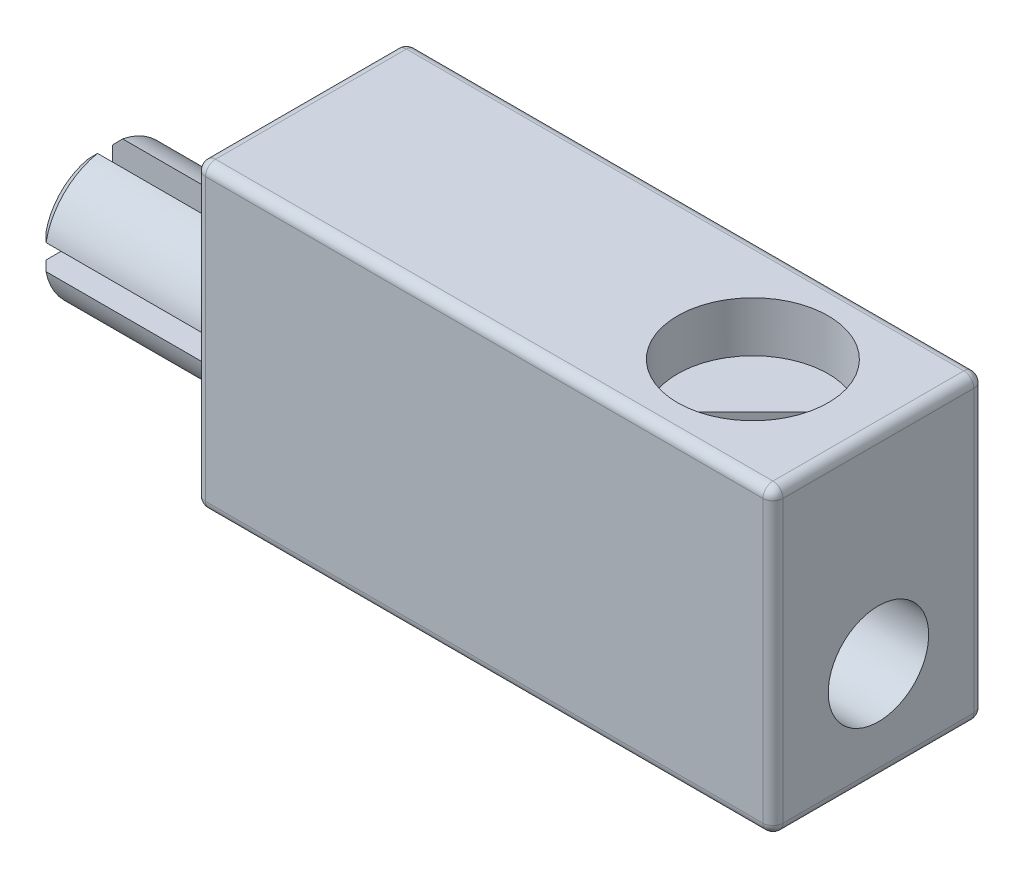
ISO-10303-21;
HEADER;
FILE_DESCRIPTION(('STEP AP214'),'2;1');
FILE_NAME('part.step','',(''),(''),'','','');
FILE_SCHEMA(('AUTOMOTIVE_DESIGN { 1 0 10303 214 1 1 1 1 }'));
ENDSEC;
DATA;
#1=APPLICATION_CONTEXT('core data for automotive mechanical design processes');
#2=APPLICATION_PROTOCOL_DEFINITION('international standard','automotive_design',2000,#1);
#3=PRODUCT_CONTEXT('',#1,'mechanical');
#4=PRODUCT('Part','Part','',(#3));
#5=PRODUCT_RELATED_PRODUCT_CATEGORY('part','',(#4));
#6=PRODUCT_DEFINITION_FORMATION('','',#4);
#7=PRODUCT_DEFINITION_CONTEXT('part definition',#1,'design');
#8=PRODUCT_DEFINITION('design','',#6,#7);
#9=PRODUCT_DEFINITION_SHAPE('','',#8);
#10=(LENGTH_UNIT() NAMED_UNIT(*) SI_UNIT(.MILLI.,.METRE.));
#11=(NAMED_UNIT(*) PLANE_ANGLE_UNIT() SI_UNIT($,.RADIAN.));
#12=(NAMED_UNIT(*) SI_UNIT($,.STERADIAN.) SOLID_ANGLE_UNIT());
#13=UNCERTAINTY_MEASURE_WITH_UNIT(LENGTH_MEASURE(1.E-05),#10,'distance_accuracy_value','');
#14=(GEOMETRIC_REPRESENTATION_CONTEXT(3) GLOBAL_UNCERTAINTY_ASSIGNED_CONTEXT((#13)) GLOBAL_UNIT_ASSIGNED_CONTEXT((#10,
#11,#12)) REPRESENTATION_CONTEXT('',''));
#15=CARTESIAN_POINT('',(0.,0.,0.));
#16=DIRECTION('',(0.,0.,1.));
#17=DIRECTION('',(1.,0.,0.));
#18=AXIS2_PLACEMENT_3D('',#15,#16,#17);
#19=CARTESIAN_POINT('',(9.,5.,2.1));
#20=DIRECTION('',(0.,1.,0.));
#21=DIRECTION('',(0.,0.,1.));
#22=AXIS2_PLACEMENT_3D('',#19,#20,#21);
#23=PLANE('',#22);
#24=DIRECTION('',(0.707106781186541,0.,-0.707106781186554));
#25=VECTOR('',#24,1.);
#26=CARTESIAN_POINT('',(9.08838834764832,5.,2.18838834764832));
#27=LINE('',#26,#25);
#28=CARTESIAN_POINT('',(8.03141743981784,5.,3.24535925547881));
#29=VERTEX_POINT('',#28);
#30=CARTESIAN_POINT('',(10.1453592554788,5.,1.13141743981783));
#31=VERTEX_POINT('',#30);
#32=EDGE_CURVE('E265',#29,#31,#27,.T.);
#33=ORIENTED_EDGE('',*,*,#32,.F.);
#34=CARTESIAN_POINT('',(9.,5.,2.1));
#35=DIRECTION('',(0.,1.,0.));
#36=DIRECTION('',(0.,0.,1.));
#37=AXIS2_PLACEMENT_3D('',#34,#35,#36);
#38=CIRCLE('',#37,1.5);
#39=EDGE_CURVE('E378',#29,#31,#38,.T.);
#40=ORIENTED_EDGE('',*,*,#39,.T.);
#41=EDGE_LOOP('',(#33,#40));
#42=FACE_BOUND('',#41,.T.);
#43=ADVANCED_FACE('F36',(#42),#23,.T.);
#44=CARTESIAN_POINT('',(2.5,2.,2.1));
#45=DIRECTION('',(1.,0.,0.));
#46=DIRECTION('',(0.,1.,0.));
#47=AXIS2_PLACEMENT_3D('',#44,#45,#46);
#48=CYLINDRICAL_SURFACE('',#47,1.);
#49=CARTESIAN_POINT('',(8.3,3.,2.1));
#50=CARTESIAN_POINT('',(8.2999981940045,3.00000167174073,2.13481091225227));
#51=CARTESIAN_POINT('',(8.30261019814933,2.99816778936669,2.16961253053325));
#52=CARTESIAN_POINT('',(8.31288332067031,2.99101752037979,2.2380935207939));
#53=CARTESIAN_POINT('',(8.32054593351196,2.98570010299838,2.27177255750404));
#54=CARTESIAN_POINT('',(8.3404333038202,2.97209881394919,2.3369124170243));
#55=CARTESIAN_POINT('',(8.35263598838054,2.96382930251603,2.36838311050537));
#56=CARTESIAN_POINT('',(8.38106325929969,2.94497073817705,2.42867836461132));
#57=CARTESIAN_POINT('',(8.39728843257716,2.93438134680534,2.45750253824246));
#58=CARTESIAN_POINT('',(8.43484244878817,2.91058928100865,2.51456624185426));
#59=CARTESIAN_POINT('',(8.45649549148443,2.89723840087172,2.54252927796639));
#60=CARTESIAN_POINT('',(8.50348484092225,2.8695782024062,2.594678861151));
#61=CARTESIAN_POINT('',(8.52882666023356,2.85526746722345,2.61885964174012));
#62=CARTESIAN_POINT('',(8.58761549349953,2.82421359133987,2.66712570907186));
#63=CARTESIAN_POINT('',(8.62170398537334,2.80748579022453,2.69044465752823));
#64=CARTESIAN_POINT('',(8.69420229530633,2.77617585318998,2.73103632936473));
#65=CARTESIAN_POINT('',(8.73260474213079,2.76159015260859,2.74831916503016));
#66=CARTESIAN_POINT('',(8.80067306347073,2.74096882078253,2.77166102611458));
#67=CARTESIAN_POINT('',(8.82933234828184,2.73368518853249,2.77953932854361));
#68=CARTESIAN_POINT('',(8.88800542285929,2.72230173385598,2.79162881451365));
#69=CARTESIAN_POINT('',(8.91801643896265,2.71819568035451,2.79584717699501));
#70=CARTESIAN_POINT('',(8.97879881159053,2.71381238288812,2.80034511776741));
#71=CARTESIAN_POINT('',(9.00957352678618,2.71355709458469,2.80060210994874));
#72=CARTESIAN_POINT('',(9.07067868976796,2.71698141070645,2.79709584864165));
#73=CARTESIAN_POINT('',(9.10100881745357,2.72066372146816,2.79332983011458));
#74=CARTESIAN_POINT('',(9.15836558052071,2.73098085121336,2.78243490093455));
#75=CARTESIAN_POINT('',(9.18547811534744,2.73740470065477,2.77554441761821));
#76=CARTESIAN_POINT('',(9.23815746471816,2.75238290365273,2.75882168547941));
#77=CARTESIAN_POINT('',(9.26372302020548,2.76093896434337,2.74898707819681));
#78=CARTESIAN_POINT('',(9.32622606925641,2.78434071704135,2.7207245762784));
#79=CARTESIAN_POINT('',(9.36200913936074,2.80011648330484,2.70050480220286));
#80=CARTESIAN_POINT('',(9.42926497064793,2.83270767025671,2.6544347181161));
#81=CARTESIAN_POINT('',(9.46072875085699,2.84952515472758,2.62857295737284));
#82=CARTESIAN_POINT('',(9.51926829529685,2.88263944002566,2.57123001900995));
#83=CARTESIAN_POINT('',(9.5462873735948,2.89892766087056,2.53968561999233));
#84=CARTESIAN_POINT('',(9.59469432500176,2.9291421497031,2.47158547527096));
#85=CARTESIAN_POINT('',(9.61609387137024,2.94307329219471,2.4350403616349));
#86=CARTESIAN_POINT('',(9.64826008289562,2.96443326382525,2.36620669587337));
#87=CARTESIAN_POINT('',(9.66033146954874,2.972618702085,2.33476264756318));
#88=CARTESIAN_POINT('',(9.67991688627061,2.98602002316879,2.2698783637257));
#89=CARTESIAN_POINT('',(9.68743402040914,2.99123792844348,2.23643950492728));
#90=CARTESIAN_POINT('',(9.69751126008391,2.99825281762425,2.1683203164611));
#91=CARTESIAN_POINT('',(9.70005125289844,3.00003592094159,2.13363552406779));
#92=CARTESIAN_POINT('',(9.69994719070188,2.99996298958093,2.06427690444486));
#93=CARTESIAN_POINT('',(9.69730336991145,2.99810711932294,2.02960307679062));
#94=CARTESIAN_POINT('',(9.68734456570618,2.99117661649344,1.96362426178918));
#95=CARTESIAN_POINT('',(9.68034566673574,2.98631993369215,1.93224709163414));
#96=CARTESIAN_POINT('',(9.66232533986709,2.97397734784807,1.87122476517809));
#97=CARTESIAN_POINT('',(9.65130316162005,2.96649095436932,1.84157993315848));
#98=CARTESIAN_POINT('',(9.62476829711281,2.94880481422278,1.78253239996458));
#99=CARTESIAN_POINT('',(9.60899325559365,2.93845067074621,1.75329495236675));
#100=CARTESIAN_POINT('',(9.5738518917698,2.91603649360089,1.69778758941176));
#101=CARTESIAN_POINT('',(9.55448331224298,2.90397538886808,1.67151955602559));
#102=CARTESIAN_POINT('',(9.50898791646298,2.8767442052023,1.61795321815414));
#103=CARTESIAN_POINT('',(9.48227180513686,2.86139511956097,1.59124644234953));
#104=CARTESIAN_POINT('',(9.42490855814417,2.83063804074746,1.5424403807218));
#105=CARTESIAN_POINT('',(9.39425833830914,2.81523001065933,1.52034474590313));
#106=CARTESIAN_POINT('',(9.33239549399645,2.78727369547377,1.48299850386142));
#107=CARTESIAN_POINT('',(9.30151748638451,2.77459284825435,1.46729515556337));
#108=CARTESIAN_POINT('',(9.23696895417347,2.75183029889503,1.44040752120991));
#109=CARTESIAN_POINT('',(9.20330404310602,2.74174353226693,1.42921440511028));
#110=CARTESIAN_POINT('',(9.14075308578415,2.7273812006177,1.41370137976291));
#111=CARTESIAN_POINT('',(9.11227795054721,2.72234284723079,1.40844912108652));
#112=CARTESIAN_POINT('',(9.0545173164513,2.71564903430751,1.40152233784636));
#113=CARTESIAN_POINT('',(9.02523291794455,2.71398919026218,1.39984317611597));
#114=CARTESIAN_POINT('',(8.96667196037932,2.71431943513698,1.40018022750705));
#115=CARTESIAN_POINT('',(8.93739545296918,2.71631390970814,1.40220088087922));
#116=CARTESIAN_POINT('',(8.87971931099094,2.7236329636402,1.40979587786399));
#117=CARTESIAN_POINT('',(8.85132102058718,2.72896240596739,1.41537541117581));
#118=CARTESIAN_POINT('',(8.78819077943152,2.74409332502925,1.43180761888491));
#119=CARTESIAN_POINT('',(8.75393632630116,2.75473288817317,1.4437047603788));
#120=CARTESIAN_POINT('',(8.68839098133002,2.77856382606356,1.47216082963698));
#121=CARTESIAN_POINT('',(8.65710479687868,2.79175915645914,1.48872700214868));
#122=CARTESIAN_POINT('',(8.59699686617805,2.81956452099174,1.52652141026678));
#123=CARTESIAN_POINT('',(8.56825145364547,2.83420074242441,1.54785117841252));
#124=CARTESIAN_POINT('',(8.5142940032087,2.86336305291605,1.5946625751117));
#125=CARTESIAN_POINT('',(8.48908313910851,2.87788910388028,1.62014557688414));
#126=CARTESIAN_POINT('',(8.43828348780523,2.90831652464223,1.68013159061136));
#127=CARTESIAN_POINT('',(8.41347790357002,2.92397951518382,1.71543156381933));
#128=CARTESIAN_POINT('',(8.37038227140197,2.95191922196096,1.79102395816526));
#129=CARTESIAN_POINT('',(8.35208461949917,2.96419988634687,1.83131047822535));
#130=CARTESIAN_POINT('',(8.32539953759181,2.98234713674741,1.9093455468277));
#131=CARTESIAN_POINT('',(8.3159345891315,2.98890117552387,1.94656252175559));
#132=CARTESIAN_POINT('',(8.30323980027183,2.99772394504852,2.02252484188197));
#133=CARTESIAN_POINT('',(8.30000200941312,2.99999813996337,2.06126817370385));
#134=CARTESIAN_POINT('',(8.3,3.,2.1));
#135=B_SPLINE_CURVE_WITH_KNOTS('',3,(#49,#50,#51,#52,#53,#54,#55,#56,#57,#58,#59,#60,#61,#62,
#63,#64,#65,#66,#67,#68,#69,#70,#71,#72,#73,#74,#75,#76,#77,#78,#79,#80,#81,#82,#83,#84,#85,#86,
#87,#88,#89,#90,#91,#92,#93,#94,#95,#96,#97,#98,#99,#100,#101,#102,#103,#104,#105,#106,#107,
#108,#109,#110,#111,#112,#113,#114,#115,#116,#117,#118,#119,#120,#121,#122,#123,#124,#125,#126,
#127,#128,#129,#130,#131,#132,#133,#134),.UNSPECIFIED.,.T.,.F.,(4,2,2,2,2,2,2,2,2,2,2,2,2,2,2,2,
2,2,2,2,2,2,2,2,2,2,2,2,2,2,2,2,2,2,2,2,2,2,2,2,2,2,4),(0.,0.104276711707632,0.208584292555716,
0.312391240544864,0.416213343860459,0.52920533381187,0.6423679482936,0.77545385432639,
0.908315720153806,0.999775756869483,1.09105598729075,1.18285646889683,1.27472008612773,
1.36051899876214,1.44638682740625,1.57776562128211,1.70941357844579,1.84262847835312,
1.97556442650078,2.0791181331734,2.18260118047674,2.28650154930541,2.39039722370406,
2.48751298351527,2.58464686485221,2.68864713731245,2.79271295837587,2.9145688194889,
3.03652080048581,3.14680036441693,3.25686296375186,3.3446607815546,3.43234458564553,
3.52013369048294,3.60805110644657,3.7208087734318,3.83374237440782,3.94936260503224,
4.06502114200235,4.20195047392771,4.33871928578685,4.45488958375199,4.57091146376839),.UNSPECIFIED.);
#136=CARTESIAN_POINT('',(8.3,3.,2.1));
#137=VERTEX_POINT('',#136);
#138=EDGE_CURVE('E313',#137,#137,#135,.T.);
#139=ORIENTED_EDGE('',*,*,#138,.T.);
#140=EDGE_LOOP('',(#139));
#141=FACE_BOUND('',#140,.T.);
#142=CARTESIAN_POINT('',(11.5,1.99999999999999,2.1));
#143=DIRECTION('',(1.,0.,0.));
#144=DIRECTION('',(0.,1.,0.));
#145=AXIS2_PLACEMENT_3D('',#142,#143,#144);
#146=CIRCLE('',#145,1.);
#147=CARTESIAN_POINT('',(11.5,2.99999999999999,2.1));
#148=VERTEX_POINT('',#147);
#149=EDGE_CURVE('E395',#148,#148,#146,.T.);
#150=ORIENTED_EDGE('',*,*,#149,.T.);
#151=EDGE_LOOP('',(#150));
#152=FACE_BOUND('',#151,.T.);
#153=CARTESIAN_POINT('',(2.5,2.,2.1));
#154=DIRECTION('',(1.,0.,0.));
#155=DIRECTION('',(0.,1.,0.));
#156=AXIS2_PLACEMENT_3D('',#153,#154,#155);
#157=CIRCLE('',#156,1.);
#158=CARTESIAN_POINT('',(2.5,3.,2.1));
#159=VERTEX_POINT('',#158);
#160=EDGE_CURVE('E391',#159,#159,#157,.T.);
#161=ORIENTED_EDGE('',*,*,#160,.F.);
#162=EDGE_LOOP('',(#161));
#163=FACE_BOUND('',#162,.T.);
#164=DIRECTION('',(1.,0.,0.));
#165=VECTOR('',#164,1.);
#166=CARTESIAN_POINT('',(2.5,2.,1.1));
#167=LINE('',#166,#165);
#168=CARTESIAN_POINT('',(5.33066238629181,2.,1.1));
#169=VERTEX_POINT('',#168);
#170=CARTESIAN_POINT('',(3.66933761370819,2.,1.1));
#171=VERTEX_POINT('',#170);
#172=EDGE_CURVE('E321',#169,#171,#167,.F.);
#173=ORIENTED_EDGE('',*,*,#172,.F.);
#174=CARTESIAN_POINT('',(5.33066238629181,2.,1.1));
#175=CARTESIAN_POINT('',(5.33064519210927,1.97666825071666,1.09999405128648));
#176=CARTESIAN_POINT('',(5.3316462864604,1.95335821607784,1.10081686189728));
#177=CARTESIAN_POINT('',(5.33553157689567,1.90706362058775,1.10405959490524));
#178=CARTESIAN_POINT('',(5.33841112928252,1.88407839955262,1.10647557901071));
#179=CARTESIAN_POINT('',(5.34953257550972,1.81654890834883,1.11593267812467));
#180=CARTESIAN_POINT('',(5.36026665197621,1.772710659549,1.1251869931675));
#181=CARTESIAN_POINT('',(5.38928960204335,1.67862163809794,1.15151774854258));
#182=CARTESIAN_POINT('',(5.40872732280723,1.62911109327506,1.16987554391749));
#183=CARTESIAN_POINT('',(5.45123233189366,1.5345576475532,1.21338282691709));
#184=CARTESIAN_POINT('',(5.47432139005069,1.48954436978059,1.23857374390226));
#185=CARTESIAN_POINT('',(5.52214155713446,1.40326782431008,1.29585231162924));
#186=CARTESIAN_POINT('',(5.54689857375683,1.36211828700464,1.32808884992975));
#187=CARTESIAN_POINT('',(5.59552007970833,1.28512242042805,1.39880480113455));
#188=CARTESIAN_POINT('',(5.61938614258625,1.24926637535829,1.43727249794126));
#189=CARTESIAN_POINT('',(5.66359198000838,1.1848503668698,1.5185350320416));
#190=CARTESIAN_POINT('',(5.68403897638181,1.15604376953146,1.56107412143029));
#191=CARTESIAN_POINT('',(5.72110716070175,1.10478173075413,1.65136723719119));
#192=CARTESIAN_POINT('',(5.73773111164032,1.08232169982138,1.69911746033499));
#193=CARTESIAN_POINT('',(5.76360966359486,1.04772923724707,1.79140741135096));
#194=CARTESIAN_POINT('',(5.77359721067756,1.03455063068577,1.83534689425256));
#195=CARTESIAN_POINT('',(5.78902613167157,1.01428602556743,1.92537914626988));
#196=CARTESIAN_POINT('',(5.79447056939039,1.00719592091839,1.97147044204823));
#197=CARTESIAN_POINT('',(5.80035964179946,0.999529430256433,2.0646509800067));
#198=CARTESIAN_POINT('',(5.80078994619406,0.998971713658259,2.11174269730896));
#199=CARTESIAN_POINT('',(5.79657384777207,1.00445655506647,2.20530994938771));
#200=CARTESIAN_POINT('',(5.79192668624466,1.01050009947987,2.2517853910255));
#201=CARTESIAN_POINT('',(5.77826397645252,1.02840832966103,2.3408002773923));
#202=CARTESIAN_POINT('',(5.76944281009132,1.04001425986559,2.38342305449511));
#203=CARTESIAN_POINT('',(5.74815741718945,1.06834335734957,2.46595287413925));
#204=CARTESIAN_POINT('',(5.73569226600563,1.0850678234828,2.50585922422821));
#205=CARTESIAN_POINT('',(5.70641424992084,1.12499189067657,2.58640426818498));
#206=CARTESIAN_POINT('',(5.68928209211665,1.14868735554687,2.62667895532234));
#207=CARTESIAN_POINT('',(5.65256530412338,1.20078266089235,2.70281242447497));
#208=CARTESIAN_POINT('',(5.63297918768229,1.22918535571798,2.73866850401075));
#209=CARTESIAN_POINT('',(5.58834632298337,1.29626061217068,2.81254372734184));
#210=CARTESIAN_POINT('',(5.56299392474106,1.33584961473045,2.84954578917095));
#211=CARTESIAN_POINT('',(5.51224884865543,1.42051354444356,2.9167771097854));
#212=CARTESIAN_POINT('',(5.48685616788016,1.46559667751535,2.94699604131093));
#213=CARTESIAN_POINT('',(5.44266846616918,1.55301892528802,2.9956946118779));
#214=CARTESIAN_POINT('',(5.42348369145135,1.59453409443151,3.01529511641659));
#215=CARTESIAN_POINT('',(5.38891011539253,1.68105487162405,3.04890142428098));
#216=CARTESIAN_POINT('',(5.37350072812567,1.72603970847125,3.0629378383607));
#217=CARTESIAN_POINT('',(5.35165910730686,1.80889101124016,3.08226898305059));
#218=CARTESIAN_POINT('',(5.34399440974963,1.84612687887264,3.08881138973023));
#219=CARTESIAN_POINT('',(5.33340889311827,1.9221767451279,3.09772266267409));
#220=CARTESIAN_POINT('',(5.33054414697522,1.96100404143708,3.10004222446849));
#221=CARTESIAN_POINT('',(5.33066238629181,2.,3.1));
#222=B_SPLINE_CURVE_WITH_KNOTS('',3,(#174,#175,#176,#177,#178,#179,#180,#181,#182,#183,#184,
#185,#186,#187,#188,#189,#190,#191,#192,#193,#194,#195,#196,#197,#198,#199,#200,#201,#202,#203,
#204,#205,#206,#207,#208,#209,#210,#211,#212,#213,#214,#215,#216,#217,#218,#219,#220,#221),
.UNSPECIFIED.,.F.,.F.,(4,2,2,2,2,2,2,2,2,2,2,2,2,2,2,2,2,2,2,2,2,2,2,4),(0.,0.0699216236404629,
0.139671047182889,0.277051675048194,0.444965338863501,0.613920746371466,0.786868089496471,
0.959493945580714,1.12472961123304,1.28984547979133,1.43008376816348,1.57022740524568,
1.71077147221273,1.85133654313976,1.9859178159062,2.12053326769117,2.26929979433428,
2.41815686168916,2.59697349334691,2.77606055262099,2.92488096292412,3.07287088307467,
3.18807803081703,3.30462187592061),.UNSPECIFIED.);
#223=CARTESIAN_POINT('',(5.33066238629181,2.,3.1));
#224=VERTEX_POINT('',#223);
#225=EDGE_CURVE('E360',#169,#224,#222,.T.);
#226=ORIENTED_EDGE('',*,*,#225,.T.);
#227=DIRECTION('',(1.,0.,0.));
#228=VECTOR('',#227,1.);
#229=CARTESIAN_POINT('',(2.5,2.,3.1));
#230=LINE('',#229,#228);
#231=CARTESIAN_POINT('',(3.66933761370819,2.,3.1));
#232=VERTEX_POINT('',#231);
#233=EDGE_CURVE('E539',#232,#224,#230,.T.);
#234=ORIENTED_EDGE('',*,*,#233,.F.);
#235=CARTESIAN_POINT('',(3.66933761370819,2.,3.1));
#236=CARTESIAN_POINT('',(3.66935480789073,1.97666825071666,3.10000594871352));
#237=CARTESIAN_POINT('',(3.6683537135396,1.95335821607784,3.09918313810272));
#238=CARTESIAN_POINT('',(3.66446842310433,1.90706362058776,3.09594040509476));
#239=CARTESIAN_POINT('',(3.66158887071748,1.88407839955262,3.09352442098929));
#240=CARTESIAN_POINT('',(3.65046742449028,1.81654890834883,3.08406732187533));
#241=CARTESIAN_POINT('',(3.63973334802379,1.772710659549,3.0748130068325));
#242=CARTESIAN_POINT('',(3.61071039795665,1.67862163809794,3.04848225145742));
#243=CARTESIAN_POINT('',(3.59127267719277,1.62911109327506,3.03012445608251));
#244=CARTESIAN_POINT('',(3.54876766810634,1.5345576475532,2.98661717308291));
#245=CARTESIAN_POINT('',(3.52567860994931,1.48954436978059,2.96142625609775));
#246=CARTESIAN_POINT('',(3.47785844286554,1.40326782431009,2.90414768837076));
#247=CARTESIAN_POINT('',(3.45310142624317,1.36211828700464,2.87191115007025));
#248=CARTESIAN_POINT('',(3.40447992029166,1.28512242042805,2.80119519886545));
#249=CARTESIAN_POINT('',(3.38061385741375,1.2492663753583,2.76272750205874));
#250=CARTESIAN_POINT('',(3.33640801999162,1.18485036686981,2.6814649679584));
#251=CARTESIAN_POINT('',(3.31596102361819,1.15604376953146,2.63892587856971));
#252=CARTESIAN_POINT('',(3.27889283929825,1.10478173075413,2.54863276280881));
#253=CARTESIAN_POINT('',(3.26226888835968,1.08232169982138,2.50088253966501));
#254=CARTESIAN_POINT('',(3.23639033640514,1.04772923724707,2.40859258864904));
#255=CARTESIAN_POINT('',(3.22640278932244,1.03455063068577,2.36465310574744));
#256=CARTESIAN_POINT('',(3.21097386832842,1.01428602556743,2.27462085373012));
#257=CARTESIAN_POINT('',(3.20552943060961,1.00719592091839,2.22852955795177));
#258=CARTESIAN_POINT('',(3.19964035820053,0.999529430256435,2.1353490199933));
#259=CARTESIAN_POINT('',(3.19921005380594,0.998971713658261,2.08825730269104));
#260=CARTESIAN_POINT('',(3.20342615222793,1.00445655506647,1.99469005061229));
#261=CARTESIAN_POINT('',(3.20807331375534,1.01050009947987,1.9482146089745));
#262=CARTESIAN_POINT('',(3.22173602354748,1.02840832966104,1.8591997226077));
#263=CARTESIAN_POINT('',(3.23055718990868,1.04001425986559,1.81657694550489));
#264=CARTESIAN_POINT('',(3.25184258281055,1.06834335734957,1.73404712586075));
#265=CARTESIAN_POINT('',(3.26430773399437,1.08506782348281,1.69414077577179));
#266=CARTESIAN_POINT('',(3.29358575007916,1.12499189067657,1.61359573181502));
#267=CARTESIAN_POINT('',(3.31071790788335,1.14868735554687,1.57332104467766));
#268=CARTESIAN_POINT('',(3.34743469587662,1.20078266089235,1.49718757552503));
#269=CARTESIAN_POINT('',(3.36702081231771,1.22918535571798,1.46133149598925));
#270=CARTESIAN_POINT('',(3.41165367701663,1.29626061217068,1.38745627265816));
#271=CARTESIAN_POINT('',(3.43700607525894,1.33584961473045,1.35045421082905));
#272=CARTESIAN_POINT('',(3.48775115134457,1.42051354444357,1.2832228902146));
#273=CARTESIAN_POINT('',(3.51314383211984,1.46559667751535,1.25300395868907));
#274=CARTESIAN_POINT('',(3.55733153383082,1.55301892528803,1.2043053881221));
#275=CARTESIAN_POINT('',(3.57651630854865,1.59453409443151,1.18470488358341));
#276=CARTESIAN_POINT('',(3.61108988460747,1.68105487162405,1.15109857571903));
#277=CARTESIAN_POINT('',(3.62649927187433,1.72603970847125,1.1370621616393));
#278=CARTESIAN_POINT('',(3.64834089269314,1.80889101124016,1.11773101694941));
#279=CARTESIAN_POINT('',(3.65600559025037,1.84612687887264,1.11118861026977));
#280=CARTESIAN_POINT('',(3.66659110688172,1.9221767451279,1.10227733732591));
#281=CARTESIAN_POINT('',(3.66945585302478,1.96100404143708,1.09995777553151));
#282=CARTESIAN_POINT('',(3.66933761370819,2.,1.1));
#283=B_SPLINE_CURVE_WITH_KNOTS('',3,(#235,#236,#237,#238,#239,#240,#241,#242,#243,#244,#245,
#246,#247,#248,#249,#250,#251,#252,#253,#254,#255,#256,#257,#258,#259,#260,#261,#262,#263,#264,
#265,#266,#267,#268,#269,#270,#271,#272,#273,#274,#275,#276,#277,#278,#279,#280,#281,#282),
.UNSPECIFIED.,.F.,.F.,(4,2,2,2,2,2,2,2,2,2,2,2,2,2,2,2,2,2,2,2,2,2,2,4),(0.,0.0699216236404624,
0.139671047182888,0.277051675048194,0.444965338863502,0.613920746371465,0.786868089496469,
0.959493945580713,1.12472961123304,1.28984547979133,1.43008376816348,1.57022740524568,
1.71077147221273,1.85133654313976,1.9859178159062,2.12053326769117,2.26929979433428,
2.41815686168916,2.59697349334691,2.77606055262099,2.92488096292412,3.07287088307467,
3.18807803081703,3.30462187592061),.UNSPECIFIED.);
#284=EDGE_CURVE('E366',#232,#171,#283,.T.);
#285=ORIENTED_EDGE('',*,*,#284,.T.);
#286=EDGE_LOOP('',(#173,#226,#234,#285));
#287=FACE_BOUND('',#286,.T.);
#288=ADVANCED_FACE('F323',(#141,#152,#163,#287),#48,.F.);
#289=CARTESIAN_POINT('',(-4.,2.,2.1));
#290=DIRECTION('',(-1.,0.,0.));
#291=DIRECTION('',(0.,0.,1.));
#292=AXIS2_PLACEMENT_3D('',#289,#290,#291);
#293=PLANE('',#292);
#294=DIRECTION('',(0.,0.,-1.));
#295=VECTOR('',#294,1.);
#296=CARTESIAN_POINT('',(-4.,2.25,0.824264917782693));
#297=LINE('',#296,#295);
#298=CARTESIAN_POINT('',(-4.,2.25,1.85));
#299=VERTEX_POINT('',#298);
#300=CARTESIAN_POINT('',(-4.,2.25,1.02878573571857));
#301=VERTEX_POINT('',#300);
#302=EDGE_CURVE('E394',#299,#301,#297,.T.);
#303=ORIENTED_EDGE('',*,*,#302,.F.);
#304=DIRECTION('',(0.,-1.,0.));
#305=VECTOR('',#304,1.);
#306=CARTESIAN_POINT('',(-4.,3.27573508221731,1.85));
#307=LINE('',#306,#305);
#308=CARTESIAN_POINT('',(-4.,3.07121426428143,1.85));
#309=VERTEX_POINT('',#308);
#310=EDGE_CURVE('E402',#309,#299,#307,.T.);
#311=ORIENTED_EDGE('',*,*,#310,.F.);
#312=CARTESIAN_POINT('',(-4.,2.,2.1));
#313=DIRECTION('',(-1.,0.,0.));
#314=DIRECTION('',(0.,0.,1.));
#315=AXIS2_PLACEMENT_3D('',#312,#313,#314);
#316=CIRCLE('',#315,1.1);
#317=EDGE_CURVE('E494',#309,#301,#316,.T.);
#318=ORIENTED_EDGE('',*,*,#317,.T.);
#319=EDGE_LOOP('',(#303,#311,#318));
#320=FACE_BOUND('',#319,.T.);
#321=ADVANCED_FACE('F563',(#320),#293,.T.);
#322=DIRECTION('',(0.,1.,0.));
#323=VECTOR('',#322,1.);
#324=CARTESIAN_POINT('',(-4.,3.27573508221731,2.35));
#325=LINE('',#324,#323);
#326=CARTESIAN_POINT('',(-4.,2.25,2.35));
#327=VERTEX_POINT('',#326);
#328=CARTESIAN_POINT('',(-4.,3.07121426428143,2.35));
#329=VERTEX_POINT('',#328);
#330=EDGE_CURVE('E446',#327,#329,#325,.T.);
#331=ORIENTED_EDGE('',*,*,#330,.F.);
#332=DIRECTION('',(0.,0.,-1.));
#333=VECTOR('',#332,1.);
#334=CARTESIAN_POINT('',(-4.,2.25,2.35));
#335=LINE('',#334,#333);
#336=CARTESIAN_POINT('',(-4.,2.25,3.17121426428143));
#337=VERTEX_POINT('',#336);
#338=EDGE_CURVE('E444',#337,#327,#335,.T.);
#339=ORIENTED_EDGE('',*,*,#338,.F.);
#340=EDGE_CURVE('E490',#337,#329,#316,.T.);
#341=ORIENTED_EDGE('',*,*,#340,.T.);
#342=EDGE_LOOP('',(#331,#339,#341));
#343=FACE_BOUND('',#342,.T.);
#344=ADVANCED_FACE('F568',(#343),#293,.T.);
#345=DIRECTION('',(0.,0.,1.));
#346=VECTOR('',#345,1.);
#347=CARTESIAN_POINT('',(-4.,1.75,2.35));
#348=LINE('',#347,#346);
#349=CARTESIAN_POINT('',(-4.,1.75,2.35));
#350=VERTEX_POINT('',#349);
#351=CARTESIAN_POINT('',(-4.,1.75,3.17121426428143));
#352=VERTEX_POINT('',#351);
#353=EDGE_CURVE('E442',#350,#352,#348,.T.);
#354=ORIENTED_EDGE('',*,*,#353,.F.);
#355=DIRECTION('',(0.,1.,0.));
#356=VECTOR('',#355,1.);
#357=CARTESIAN_POINT('',(-4.,1.75,2.35));
#358=LINE('',#357,#356);
#359=CARTESIAN_POINT('',(-4.,0.928785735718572,2.35));
#360=VERTEX_POINT('',#359);
#361=EDGE_CURVE('E440',#360,#350,#358,.T.);
#362=ORIENTED_EDGE('',*,*,#361,.F.);
#363=EDGE_CURVE('E487',#360,#352,#316,.T.);
#364=ORIENTED_EDGE('',*,*,#363,.T.);
#365=EDGE_LOOP('',(#354,#362,#364));
#366=FACE_BOUND('',#365,.T.);
#367=ADVANCED_FACE('F634',(#366),#293,.T.);
#368=CARTESIAN_POINT('',(-4.,2.,2.1));
#369=DIRECTION('',(1.,0.,0.));
#370=DIRECTION('',(0.,0.,-1.));
#371=AXIS2_PLACEMENT_3D('',#368,#369,#370);
#372=CONICAL_SURFACE('',#371,1.1,0.785398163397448);
#373=CARTESIAN_POINT('',(-4.82716875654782,2.25,1.99074393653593));
#374=CARTESIAN_POINT('',(-4.82354018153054,2.25,1.98169147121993));
#375=CARTESIAN_POINT('',(-4.81959509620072,2.25,1.97277501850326));
#376=CARTESIAN_POINT('',(-4.81119569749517,2.25,1.95519718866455));
#377=CARTESIAN_POINT('',(-4.80674200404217,2.25,1.94653551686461));
#378=CARTESIAN_POINT('',(-4.79282718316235,2.25,1.92094575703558));
#379=CARTESIAN_POINT('',(-4.78278041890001,2.25,1.90433873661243));
#380=CARTESIAN_POINT('',(-4.76176643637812,2.25,1.87184663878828));
#381=CARTESIAN_POINT('',(-4.75080382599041,2.25,1.85595850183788));
#382=CARTESIAN_POINT('',(-4.72822760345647,2.25,1.82462290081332));
#383=CARTESIAN_POINT('',(-4.71661314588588,2.25,1.80917605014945));
#384=CARTESIAN_POINT('',(-4.69001034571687,2.25,1.77482703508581));
#385=CARTESIAN_POINT('',(-4.67490052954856,2.25,1.75601960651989));
#386=CARTESIAN_POINT('',(-4.64423264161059,2.25,1.71877258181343));
#387=CARTESIAN_POINT('',(-4.62867451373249,2.25,1.70033303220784));
#388=CARTESIAN_POINT('',(-4.58153170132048,2.25,1.64539233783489));
#389=CARTESIAN_POINT('',(-4.54949059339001,2.25,1.60928411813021));
#390=CARTESIAN_POINT('',(-4.48475305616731,2.25,1.53763095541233));
#391=CARTESIAN_POINT('',(-4.45205627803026,2.25,1.50208633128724));
#392=CARTESIAN_POINT('',(-4.38627884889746,2.25,1.43137064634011));
#393=CARTESIAN_POINT('',(-4.35319829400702,2.25,1.39619949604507));
#394=CARTESIAN_POINT('',(-4.25283581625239,2.25,1.29023922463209));
#395=CARTESIAN_POINT('',(-4.18517547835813,2.25,1.21980950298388));
#396=CARTESIAN_POINT('',(-4.0494142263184,2.25,1.07944389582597));
#397=CARTESIAN_POINT('',(-3.98131353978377,2.25,1.00950778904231));
#398=CARTESIAN_POINT('',(-3.83144268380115,2.25,0.856195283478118));
#399=CARTESIAN_POINT('',(-3.74961398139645,2.25,0.772876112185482));
#400=CARTESIAN_POINT('',(-3.58572586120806,2.25,0.606436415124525));
#401=CARTESIAN_POINT('',(-3.50366640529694,2.25,0.523315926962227));
#402=CARTESIAN_POINT('',(-3.34069152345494,2.25,0.358501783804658));
#403=CARTESIAN_POINT('',(-3.25977818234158,2.25,0.276806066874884));
#404=CARTESIAN_POINT('',(-3.09787587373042,2.25,0.113519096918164));
#405=CARTESIAN_POINT('',(-3.01688692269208,2.25,0.0319278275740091));
#406=CARTESIAN_POINT('',(-2.93587298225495,2.25,-0.0496385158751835));
#407=B_SPLINE_CURVE_WITH_KNOTS('',3,(#373,#374,#375,#376,#377,#378,#379,#380,#381,#382,#383,
#384,#385,#386,#387,#388,#389,#390,#391,#392,#393,#394,#395,#396,#397,#398,#399,#400,#401,#402,
#403,#404,#405,#406),.UNSPECIFIED.,.F.,.F.,(4,2,2,2,2,2,2,2,2,2,2,2,2,2,2,2,4),(0.,
0.0292393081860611,0.0584433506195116,0.116610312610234,0.174500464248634,0.23246751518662,
0.304832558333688,0.377206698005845,0.522012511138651,0.66689752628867,0.811747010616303,
1.1047334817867,1.39757900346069,1.74792389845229,2.09833055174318,2.44328035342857,
2.78816732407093),.UNSPECIFIED.);
#408=CARTESIAN_POINT('',(-3.8,2.25,0.824264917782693));
#409=VERTEX_POINT('',#408);
#410=EDGE_CURVE('E534',#301,#409,#407,.T.);
#411=ORIENTED_EDGE('',*,*,#410,.F.);
#412=ORIENTED_EDGE('',*,*,#317,.F.);
#413=CARTESIAN_POINT('',(-2.93587298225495,4.14963851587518,1.85));
#414=CARTESIAN_POINT('',(-3.01759188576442,4.06736215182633,1.85));
#415=CARTESIAN_POINT('',(-3.09928553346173,3.98506059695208,1.85));
#416=CARTESIAN_POINT('',(-3.26255036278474,3.82039649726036,1.85));
#417=CARTESIAN_POINT('',(-3.34412157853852,3.73803398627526,1.85));
#418=CARTESIAN_POINT('',(-3.50704751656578,3.57326008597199,1.85));
#419=CARTESIAN_POINT('',(-3.58840237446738,3.49084883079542,1.85));
#420=CARTESIAN_POINT('',(-3.75092774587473,3.32578606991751,1.85));
#421=CARTESIAN_POINT('',(-3.83209818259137,3.24313448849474,1.85));
#422=CARTESIAN_POINT('',(-3.95365319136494,3.11878759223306,1.85));
#423=CARTESIAN_POINT('',(-3.99418118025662,3.07723254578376,1.85));
#424=CARTESIAN_POINT('',(-4.07509467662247,2.99399544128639,1.85));
#425=CARTESIAN_POINT('',(-4.11548020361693,2.95231340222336,1.85));
#426=CARTESIAN_POINT('',(-4.19600935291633,2.86880485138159,1.85));
#427=CARTESIAN_POINT('',(-4.23615319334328,2.82697855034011,1.85));
#428=CARTESIAN_POINT('',(-4.31615764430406,2.7430149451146,1.85));
#429=CARTESIAN_POINT('',(-4.35601809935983,2.70087749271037,1.85));
#430=CARTESIAN_POINT('',(-4.43539769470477,2.61597842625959,1.85));
#431=CARTESIAN_POINT('',(-4.47491496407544,2.57321504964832,1.85));
#432=CARTESIAN_POINT('',(-4.53346087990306,2.5084770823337,1.85));
#433=CARTESIAN_POINT('',(-4.55283789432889,2.48681814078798,1.85));
#434=CARTESIAN_POINT('',(-4.59126568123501,2.44319113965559,1.85));
#435=CARTESIAN_POINT('',(-4.61031627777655,2.42122292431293,1.85));
#436=CARTESIAN_POINT('',(-4.64802555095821,2.3767245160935,1.85));
#437=CARTESIAN_POINT('',(-4.66668119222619,2.35419174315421,1.85));
#438=CARTESIAN_POINT('',(-4.7031592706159,2.30850339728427,1.85));
#439=CARTESIAN_POINT('',(-4.72098288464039,2.28534878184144,1.85));
#440=CARTESIAN_POINT('',(-4.74671118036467,2.24975902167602,1.85));
#441=CARTESIAN_POINT('',(-4.75514664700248,2.23770991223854,1.85));
#442=CARTESIAN_POINT('',(-4.77150839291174,2.21328170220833,1.85));
#443=CARTESIAN_POINT('',(-4.77943503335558,2.20090284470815,1.85));
#444=CARTESIAN_POINT('',(-4.79463173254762,2.17565050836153,1.85));
#445=CARTESIAN_POINT('',(-4.80189817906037,2.16277480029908,1.85));
#446=CARTESIAN_POINT('',(-4.81540099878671,2.1364579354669,1.85));
#447=CARTESIAN_POINT('',(-4.82163470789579,2.1230154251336,1.85));
#448=CARTESIAN_POINT('',(-4.82716875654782,2.10925606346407,1.85));
#449=B_SPLINE_CURVE_WITH_KNOTS('',3,(#413,#414,#415,#416,#417,#418,#419,#420,#421,#422,#423,
#424,#425,#426,#427,#428,#429,#430,#431,#432,#433,#434,#435,#436,#437,#438,#439,#440,#441,#442,
#443,#444,#445,#446,#447,#448),.UNSPECIFIED.,.F.,.F.,(4,2,2,2,2,2,2,2,2,2,2,2,2,2,2,2,2,4),(0.,
0.347888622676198,0.695648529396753,1.0430559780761,1.39058832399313,1.56472614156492,
1.73883909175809,1.91275949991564,2.08676892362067,2.26143913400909,2.34862189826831,
2.43585026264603,2.52360172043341,2.61122503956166,2.65534083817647,2.69942496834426,
2.74373736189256,2.78816234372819),.UNSPECIFIED.);
#450=CARTESIAN_POINT('',(-3.8,3.27573508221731,1.85));
#451=VERTEX_POINT('',#450);
#452=EDGE_CURVE('E540',#451,#309,#449,.T.);
#453=ORIENTED_EDGE('',*,*,#452,.F.);
#454=CARTESIAN_POINT('',(-3.8,2.,2.1));
#455=DIRECTION('',(-1.,0.,0.));
#456=DIRECTION('',(0.,0.,1.));
#457=AXIS2_PLACEMENT_3D('',#454,#455,#456);
#458=CIRCLE('',#457,1.3);
#459=EDGE_CURVE('E653',#409,#451,#458,.F.);
#460=ORIENTED_EDGE('',*,*,#459,.F.);
#461=EDGE_LOOP('',(#411,#412,#453,#460));
#462=FACE_BOUND('',#461,.T.);
#463=ADVANCED_FACE('F650',(#462),#372,.T.);
#464=CARTESIAN_POINT('',(-4.82716875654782,2.10925606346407,2.35));
#465=CARTESIAN_POINT('',(-4.82354018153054,2.11830852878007,2.35));
#466=CARTESIAN_POINT('',(-4.81959509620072,2.12722498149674,2.35));
#467=CARTESIAN_POINT('',(-4.81119569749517,2.14480281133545,2.35));
#468=CARTESIAN_POINT('',(-4.80674200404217,2.15346448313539,2.35));
#469=CARTESIAN_POINT('',(-4.79282718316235,2.17905424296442,2.35));
#470=CARTESIAN_POINT('',(-4.78278041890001,2.19566126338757,2.35));
#471=CARTESIAN_POINT('',(-4.76176643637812,2.22815336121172,2.35));
#472=CARTESIAN_POINT('',(-4.75080382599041,2.24404149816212,2.35));
#473=CARTESIAN_POINT('',(-4.72822760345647,2.27537709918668,2.35));
#474=CARTESIAN_POINT('',(-4.71661314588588,2.29082394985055,2.35));
#475=CARTESIAN_POINT('',(-4.69001034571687,2.32517296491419,2.35));
#476=CARTESIAN_POINT('',(-4.67490052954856,2.34398039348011,2.35));
#477=CARTESIAN_POINT('',(-4.64423264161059,2.38122741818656,2.35));
#478=CARTESIAN_POINT('',(-4.62867451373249,2.39966696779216,2.35));
#479=CARTESIAN_POINT('',(-4.58153170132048,2.45460766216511,2.35));
#480=CARTESIAN_POINT('',(-4.54949059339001,2.49071588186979,2.35));
#481=CARTESIAN_POINT('',(-4.48475305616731,2.56236904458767,2.35));
#482=CARTESIAN_POINT('',(-4.45205627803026,2.59791366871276,2.35));
#483=CARTESIAN_POINT('',(-4.38627884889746,2.66862935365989,2.35));
#484=CARTESIAN_POINT('',(-4.35319829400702,2.70380050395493,2.35));
#485=CARTESIAN_POINT('',(-4.25283581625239,2.80976077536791,2.35));
#486=CARTESIAN_POINT('',(-4.18517547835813,2.88019049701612,2.35));
#487=CARTESIAN_POINT('',(-4.0494142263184,3.02055610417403,2.35));
#488=CARTESIAN_POINT('',(-3.98131353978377,3.09049221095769,2.35));
#489=CARTESIAN_POINT('',(-3.83144268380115,3.24380471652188,2.35));
#490=CARTESIAN_POINT('',(-3.74961398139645,3.32712388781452,2.35));
#491=CARTESIAN_POINT('',(-3.58572586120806,3.49356358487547,2.35));
#492=CARTESIAN_POINT('',(-3.50366640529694,3.57668407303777,2.35));
#493=CARTESIAN_POINT('',(-3.34069152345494,3.74149821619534,2.35));
#494=CARTESIAN_POINT('',(-3.25977818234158,3.82319393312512,2.35));
#495=CARTESIAN_POINT('',(-3.09787587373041,3.98648090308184,2.35));
#496=CARTESIAN_POINT('',(-3.01688692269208,4.06807217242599,2.35));
#497=CARTESIAN_POINT('',(-2.93587298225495,4.14963851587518,2.35));
#498=B_SPLINE_CURVE_WITH_KNOTS('',3,(#464,#465,#466,#467,#468,#469,#470,#471,#472,#473,#474,
#475,#476,#477,#478,#479,#480,#481,#482,#483,#484,#485,#486,#487,#488,#489,#490,#491,#492,#493,
#494,#495,#496,#497),.UNSPECIFIED.,.F.,.F.,(4,2,2,2,2,2,2,2,2,2,2,2,2,2,2,2,4),(0.,
0.0292393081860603,0.0584433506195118,0.116610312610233,0.174500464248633,0.232467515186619,
0.304832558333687,0.377206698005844,0.522012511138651,0.66689752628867,0.811747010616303,
1.1047334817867,1.39757900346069,1.74792389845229,2.09833055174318,2.44328035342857,
2.78816732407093),.UNSPECIFIED.);
#499=CARTESIAN_POINT('',(-3.8,3.27573508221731,2.35));
#500=VERTEX_POINT('',#499);
#501=EDGE_CURVE('E595',#329,#500,#498,.T.);
#502=ORIENTED_EDGE('',*,*,#501,.F.);
#503=ORIENTED_EDGE('',*,*,#340,.F.);
#504=CARTESIAN_POINT('',(-2.93587298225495,2.25,4.24963851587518));
#505=CARTESIAN_POINT('',(-3.01759188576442,2.25,4.16736215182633));
#506=CARTESIAN_POINT('',(-3.09928553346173,2.25,4.08506059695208));
#507=CARTESIAN_POINT('',(-3.26255036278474,2.25,3.92039649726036));
#508=CARTESIAN_POINT('',(-3.34412157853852,2.25,3.83803398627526));
#509=CARTESIAN_POINT('',(-3.50704751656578,2.25,3.67326008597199));
#510=CARTESIAN_POINT('',(-3.58840237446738,2.25,3.59084883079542));
#511=CARTESIAN_POINT('',(-3.75092774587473,2.25,3.42578606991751));
#512=CARTESIAN_POINT('',(-3.83209818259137,2.25,3.34313448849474));
#513=CARTESIAN_POINT('',(-3.95365319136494,2.25,3.21878759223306));
#514=CARTESIAN_POINT('',(-3.99418118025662,2.25,3.17723254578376));
#515=CARTESIAN_POINT('',(-4.07509467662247,2.25,3.09399544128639));
#516=CARTESIAN_POINT('',(-4.11548020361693,2.25,3.05231340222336));
#517=CARTESIAN_POINT('',(-4.19600935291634,2.25,2.96880485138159));
#518=CARTESIAN_POINT('',(-4.23615319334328,2.25,2.92697855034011));
#519=CARTESIAN_POINT('',(-4.31615764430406,2.25,2.8430149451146));
#520=CARTESIAN_POINT('',(-4.35601809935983,2.25,2.80087749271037));
#521=CARTESIAN_POINT('',(-4.43539769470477,2.25,2.71597842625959));
#522=CARTESIAN_POINT('',(-4.47491496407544,2.25,2.67321504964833));
#523=CARTESIAN_POINT('',(-4.53346087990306,2.25,2.6084770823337));
#524=CARTESIAN_POINT('',(-4.55283789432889,2.25,2.58681814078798));
#525=CARTESIAN_POINT('',(-4.59126568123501,2.25,2.54319113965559));
#526=CARTESIAN_POINT('',(-4.61031627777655,2.25,2.52122292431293));
#527=CARTESIAN_POINT('',(-4.64802555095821,2.25,2.4767245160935));
#528=CARTESIAN_POINT('',(-4.66668119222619,2.25,2.45419174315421));
#529=CARTESIAN_POINT('',(-4.7031592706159,2.25,2.40850339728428));
#530=CARTESIAN_POINT('',(-4.72098288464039,2.25,2.38534878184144));
#531=CARTESIAN_POINT('',(-4.74671118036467,2.25,2.34975902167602));
#532=CARTESIAN_POINT('',(-4.75514664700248,2.25,2.33770991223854));
#533=CARTESIAN_POINT('',(-4.77150839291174,2.25,2.31328170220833));
#534=CARTESIAN_POINT('',(-4.77943503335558,2.25,2.30090284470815));
#535=CARTESIAN_POINT('',(-4.79463173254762,2.25,2.27565050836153));
#536=CARTESIAN_POINT('',(-4.80189817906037,2.25,2.26277480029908));
#537=CARTESIAN_POINT('',(-4.81540099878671,2.25,2.2364579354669));
#538=CARTESIAN_POINT('',(-4.82163470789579,2.25,2.2230154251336));
#539=CARTESIAN_POINT('',(-4.82716875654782,2.25,2.20925606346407));
#540=B_SPLINE_CURVE_WITH_KNOTS('',3,(#504,#505,#506,#507,#508,#509,#510,#511,#512,#513,#514,
#515,#516,#517,#518,#519,#520,#521,#522,#523,#524,#525,#526,#527,#528,#529,#530,#531,#532,#533,
#534,#535,#536,#537,#538,#539),.UNSPECIFIED.,.F.,.F.,(4,2,2,2,2,2,2,2,2,2,2,2,2,2,2,2,2,4),(0.,
0.347888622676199,0.695648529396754,1.0430559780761,1.39058832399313,1.56472614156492,
1.73883909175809,1.91275949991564,2.08676892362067,2.26143913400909,2.34862189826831,
2.43585026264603,2.5236017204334,2.61122503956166,2.65534083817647,2.69942496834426,
2.74373736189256,2.78816234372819),.UNSPECIFIED.);
#541=CARTESIAN_POINT('',(-3.8,2.25,3.37573508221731));
#542=VERTEX_POINT('',#541);
#543=EDGE_CURVE('E600',#542,#337,#540,.T.);
#544=ORIENTED_EDGE('',*,*,#543,.F.);
#545=EDGE_CURVE('E493',#500,#542,#458,.F.);
#546=ORIENTED_EDGE('',*,*,#545,.F.);
#547=EDGE_LOOP('',(#502,#503,#544,#546));
#548=FACE_BOUND('',#547,.T.);
#549=ADVANCED_FACE('F671',(#548),#372,.T.);
#550=CARTESIAN_POINT('',(-4.82716875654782,1.75,2.20925606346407));
#551=CARTESIAN_POINT('',(-4.82354018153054,1.75,2.21830852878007));
#552=CARTESIAN_POINT('',(-4.81959509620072,1.75,2.22722498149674));
#553=CARTESIAN_POINT('',(-4.81119569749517,1.75,2.24480281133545));
#554=CARTESIAN_POINT('',(-4.80674200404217,1.75,2.25346448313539));
#555=CARTESIAN_POINT('',(-4.79282718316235,1.75,2.27905424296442));
#556=CARTESIAN_POINT('',(-4.78278041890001,1.75,2.29566126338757));
#557=CARTESIAN_POINT('',(-4.76176643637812,1.75,2.32815336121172));
#558=CARTESIAN_POINT('',(-4.75080382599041,1.75,2.34404149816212));
#559=CARTESIAN_POINT('',(-4.72822760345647,1.75,2.37537709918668));
#560=CARTESIAN_POINT('',(-4.71661314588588,1.75,2.39082394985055));
#561=CARTESIAN_POINT('',(-4.69001034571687,1.75,2.42517296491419));
#562=CARTESIAN_POINT('',(-4.67490052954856,1.75,2.44398039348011));
#563=CARTESIAN_POINT('',(-4.64423264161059,1.75,2.48122741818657));
#564=CARTESIAN_POINT('',(-4.62867451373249,1.75,2.49966696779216));
#565=CARTESIAN_POINT('',(-4.58153170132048,1.75,2.55460766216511));
#566=CARTESIAN_POINT('',(-4.54949059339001,1.75,2.59071588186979));
#567=CARTESIAN_POINT('',(-4.48475305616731,1.75,2.66236904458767));
#568=CARTESIAN_POINT('',(-4.45205627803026,1.75,2.69791366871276));
#569=CARTESIAN_POINT('',(-4.38627884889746,1.75,2.76862935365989));
#570=CARTESIAN_POINT('',(-4.35319829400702,1.75,2.80380050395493));
#571=CARTESIAN_POINT('',(-4.2528358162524,1.75,2.90976077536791));
#572=CARTESIAN_POINT('',(-4.18517547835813,1.75,2.98019049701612));
#573=CARTESIAN_POINT('',(-4.0494142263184,1.75,3.12055610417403));
#574=CARTESIAN_POINT('',(-3.98131353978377,1.75,3.19049221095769));
#575=CARTESIAN_POINT('',(-3.83144268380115,1.75,3.34380471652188));
#576=CARTESIAN_POINT('',(-3.74961398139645,1.75,3.42712388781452));
#577=CARTESIAN_POINT('',(-3.58572586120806,1.75,3.59356358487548));
#578=CARTESIAN_POINT('',(-3.50366640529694,1.75,3.67668407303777));
#579=CARTESIAN_POINT('',(-3.34069152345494,1.75,3.84149821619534));
#580=CARTESIAN_POINT('',(-3.25977818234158,1.75,3.92319393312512));
#581=CARTESIAN_POINT('',(-3.09787587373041,1.75,4.08648090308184));
#582=CARTESIAN_POINT('',(-3.01688692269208,1.75,4.16807217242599));
#583=CARTESIAN_POINT('',(-2.93587298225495,1.75,4.24963851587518));
#584=B_SPLINE_CURVE_WITH_KNOTS('',3,(#550,#551,#552,#553,#554,#555,#556,#557,#558,#559,#560,
#561,#562,#563,#564,#565,#566,#567,#568,#569,#570,#571,#572,#573,#574,#575,#576,#577,#578,#579,
#580,#581,#582,#583),.UNSPECIFIED.,.F.,.F.,(4,2,2,2,2,2,2,2,2,2,2,2,2,2,2,2,4),(0.,
0.0292393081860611,0.0584433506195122,0.116610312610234,0.174500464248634,0.23246751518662,
0.304832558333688,0.377206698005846,0.522012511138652,0.66689752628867,0.811747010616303,
1.1047334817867,1.39757900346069,1.7479238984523,2.09833055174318,2.44328035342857,
2.78816732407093),.UNSPECIFIED.);
#585=CARTESIAN_POINT('',(-3.8,1.75,3.37573508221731));
#586=VERTEX_POINT('',#585);
#587=EDGE_CURVE('E605',#352,#586,#584,.T.);
#588=ORIENTED_EDGE('',*,*,#587,.F.);
#589=ORIENTED_EDGE('',*,*,#363,.F.);
#590=CARTESIAN_POINT('',(-2.93587298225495,-0.149638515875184,2.35));
#591=CARTESIAN_POINT('',(-3.01759188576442,-0.0673621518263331,2.35));
#592=CARTESIAN_POINT('',(-3.09928553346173,0.0149394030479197,2.35));
#593=CARTESIAN_POINT('',(-3.26255036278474,0.179603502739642,2.35));
#594=CARTESIAN_POINT('',(-3.34412157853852,0.261966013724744,2.35));
#595=CARTESIAN_POINT('',(-3.50704751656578,0.426739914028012,2.35));
#596=CARTESIAN_POINT('',(-3.58840237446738,0.509151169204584,2.35));
#597=CARTESIAN_POINT('',(-3.75092774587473,0.67421393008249,2.35));
#598=CARTESIAN_POINT('',(-3.83209818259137,0.756865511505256,2.35));
#599=CARTESIAN_POINT('',(-3.95365319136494,0.881212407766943,2.35));
#600=CARTESIAN_POINT('',(-3.99418118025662,0.922767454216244,2.35));
#601=CARTESIAN_POINT('',(-4.07509467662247,1.00600455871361,2.35));
#602=CARTESIAN_POINT('',(-4.11548020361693,1.04768659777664,2.35));
#603=CARTESIAN_POINT('',(-4.19600935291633,1.13119514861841,2.35));
#604=CARTESIAN_POINT('',(-4.23615319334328,1.17302144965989,2.35));
#605=CARTESIAN_POINT('',(-4.31615764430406,1.2569850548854,2.35));
#606=CARTESIAN_POINT('',(-4.35601809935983,1.29912250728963,2.35));
#607=CARTESIAN_POINT('',(-4.43539769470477,1.38402157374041,2.35));
#608=CARTESIAN_POINT('',(-4.47491496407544,1.42678495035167,2.35));
#609=CARTESIAN_POINT('',(-4.53346087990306,1.4915229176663,2.35));
#610=CARTESIAN_POINT('',(-4.55283789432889,1.51318185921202,2.35));
#611=CARTESIAN_POINT('',(-4.59126568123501,1.55680886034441,2.35));
#612=CARTESIAN_POINT('',(-4.61031627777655,1.57877707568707,2.35));
#613=CARTESIAN_POINT('',(-4.64802555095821,1.6232754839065,2.35));
#614=CARTESIAN_POINT('',(-4.66668119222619,1.64580825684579,2.35));
#615=CARTESIAN_POINT('',(-4.7031592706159,1.69149660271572,2.35));
#616=CARTESIAN_POINT('',(-4.72098288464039,1.71465121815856,2.35));
#617=CARTESIAN_POINT('',(-4.74671118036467,1.75024097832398,2.35));
#618=CARTESIAN_POINT('',(-4.75514664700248,1.76229008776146,2.35));
#619=CARTESIAN_POINT('',(-4.77150839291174,1.78671829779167,2.35));
#620=CARTESIAN_POINT('',(-4.77943503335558,1.79909715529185,2.35));
#621=CARTESIAN_POINT('',(-4.79463173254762,1.82434949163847,2.35));
#622=CARTESIAN_POINT('',(-4.80189817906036,1.83722519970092,2.35));
#623=CARTESIAN_POINT('',(-4.81540099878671,1.8635420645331,2.35));
#624=CARTESIAN_POINT('',(-4.82163470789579,1.8769845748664,2.35));
#625=CARTESIAN_POINT('',(-4.82716875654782,1.89074393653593,2.35));
#626=B_SPLINE_CURVE_WITH_KNOTS('',3,(#590,#591,#592,#593,#594,#595,#596,#597,#598,#599,#600,
#601,#602,#603,#604,#605,#606,#607,#608,#609,#610,#611,#612,#613,#614,#615,#616,#617,#618,#619,
#620,#621,#622,#623,#624,#625),.UNSPECIFIED.,.F.,.F.,(4,2,2,2,2,2,2,2,2,2,2,2,2,2,2,2,2,4),(0.,
0.347888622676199,0.695648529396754,1.0430559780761,1.39058832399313,1.56472614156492,
1.73883909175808,1.91275949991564,2.08676892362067,2.26143913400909,2.34862189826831,
2.43585026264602,2.5236017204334,2.61122503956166,2.65534083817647,2.69942496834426,
2.74373736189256,2.78816234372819),.UNSPECIFIED.);
#627=CARTESIAN_POINT('',(-3.8,0.724264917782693,2.35));
#628=VERTEX_POINT('',#627);
#629=EDGE_CURVE('E609',#628,#360,#626,.T.);
#630=ORIENTED_EDGE('',*,*,#629,.F.);
#631=EDGE_CURVE('E495',#586,#628,#458,.F.);
#632=ORIENTED_EDGE('',*,*,#631,.F.);
#633=EDGE_LOOP('',(#588,#589,#630,#632));
#634=FACE_BOUND('',#633,.T.);
#635=ADVANCED_FACE('F636',(#634),#372,.T.);
#636=CARTESIAN_POINT('',(2.,2.,2.1));
#637=DIRECTION('',(-1.,0.,0.));
#638=DIRECTION('',(0.,0.,1.));
#639=AXIS2_PLACEMENT_3D('',#636,#637,#638);
#640=PLANE('',#639);
#641=CARTESIAN_POINT('',(2.,2.,2.1));
#642=DIRECTION('',(-1.,0.,0.));
#643=DIRECTION('',(0.,0.,1.));
#644=AXIS2_PLACEMENT_3D('',#641,#642,#643);
#645=CIRCLE('',#644,1.5);
#646=CARTESIAN_POINT('',(2.,2.,3.6));
#647=VERTEX_POINT('',#646);
#648=EDGE_CURVE('E484',#647,#647,#645,.T.);
#649=ORIENTED_EDGE('',*,*,#648,.T.);
#650=EDGE_LOOP('',(#649));
#651=FACE_BOUND('',#650,.T.);
#652=CARTESIAN_POINT('',(2.,2.,2.1));
#653=DIRECTION('',(-1.,0.,0.));
#654=DIRECTION('',(0.,0.,1.));
#655=AXIS2_PLACEMENT_3D('',#652,#653,#654);
#656=CIRCLE('',#655,1.3);
#657=CARTESIAN_POINT('',(2.,2.,3.4));
#658=VERTEX_POINT('',#657);
#659=EDGE_CURVE('E452',#658,#658,#656,.T.);
#660=ORIENTED_EDGE('',*,*,#659,.F.);
#661=EDGE_LOOP('',(#660));
#662=FACE_BOUND('',#661,.T.);
#663=ADVANCED_FACE('F708',(#651,#662),#640,.T.);
#664=CARTESIAN_POINT('',(0.,0.,4.2));
#665=DIRECTION('',(1.,0.,0.));
#666=DIRECTION('',(0.,0.,-1.));
#667=AXIS2_PLACEMENT_3D('',#664,#665,#666);
#668=PLANE('',#667);
#669=DIRECTION('',(0.,-1.,0.));
#670=VECTOR('',#669,1.);
#671=CARTESIAN_POINT('',(0.,0.,0.2));
#672=LINE('',#671,#670);
#673=CARTESIAN_POINT('',(0.,5.8,0.2));
#674=VERTEX_POINT('',#673);
#675=CARTESIAN_POINT('',(0.,0.2,0.2));
#676=VERTEX_POINT('',#675);
#677=EDGE_CURVE('E1160',#674,#676,#672,.T.);
#678=ORIENTED_EDGE('',*,*,#677,.T.);
#679=DIRECTION('',(0.,0.,-1.));
#680=VECTOR('',#679,1.);
#681=CARTESIAN_POINT('',(0.,0.2,4.2));
#682=LINE('',#681,#680);
#683=CARTESIAN_POINT('',(0.,0.2,4.));
#684=VERTEX_POINT('',#683);
#685=EDGE_CURVE('E1135',#676,#684,#682,.F.);
#686=ORIENTED_EDGE('',*,*,#685,.T.);
#687=DIRECTION('',(0.,-1.,0.));
#688=VECTOR('',#687,1.);
#689=CARTESIAN_POINT('',(0.,0.,4.));
#690=LINE('',#689,#688);
#691=CARTESIAN_POINT('',(0.,5.8,4.));
#692=VERTEX_POINT('',#691);
#693=EDGE_CURVE('E1152',#684,#692,#690,.F.);
#694=ORIENTED_EDGE('',*,*,#693,.T.);
#695=DIRECTION('',(0.,0.,-1.));
#696=VECTOR('',#695,1.);
#697=CARTESIAN_POINT('',(0.,5.8,4.2));
#698=LINE('',#697,#696);
#699=EDGE_CURVE('E1156',#692,#674,#698,.T.);
#700=ORIENTED_EDGE('',*,*,#699,.T.);
#701=EDGE_LOOP('',(#678,#686,#694,#700));
#702=FACE_BOUND('',#701,.T.);
#703=CARTESIAN_POINT('',(0.,2.,2.1));
#704=DIRECTION('',(-1.,0.,0.));
#705=DIRECTION('',(0.,0.,1.));
#706=AXIS2_PLACEMENT_3D('',#703,#704,#705);
#707=CIRCLE('',#706,1.5);
#708=CARTESIAN_POINT('',(0.,2.,3.6));
#709=VERTEX_POINT('',#708);
#710=EDGE_CURVE('E483',#709,#709,#707,.T.);
#711=ORIENTED_EDGE('',*,*,#710,.F.);
#712=EDGE_LOOP('',(#711));
#713=FACE_BOUND('',#712,.T.);
#714=ADVANCED_FACE('F713',(#702,#713),#668,.F.);
#715=CARTESIAN_POINT('',(0.,0.,4.2));
#716=DIRECTION('',(0.,1.,0.));
#717=DIRECTION('',(0.,0.,1.));
#718=AXIS2_PLACEMENT_3D('',#715,#716,#717);
#719=PLANE('',#718);
#720=DIRECTION('',(1.,0.,0.));
#721=VECTOR('',#720,1.);
#722=CARTESIAN_POINT('',(0.,0.,4.));
#723=LINE('',#722,#721);
#724=CARTESIAN_POINT('',(11.3,0.,4.));
#725=VERTEX_POINT('',#724);
#726=CARTESIAN_POINT('',(0.2,0.,4.));
#727=VERTEX_POINT('',#726);
#728=EDGE_CURVE('E320',#725,#727,#723,.F.);
#729=ORIENTED_EDGE('',*,*,#728,.T.);
#730=DIRECTION('',(0.,0.,-1.));
#731=VECTOR('',#730,1.);
#732=CARTESIAN_POINT('',(0.2,0.,4.2));
#733=LINE('',#732,#731);
#734=CARTESIAN_POINT('',(0.2,0.,0.2));
#735=VERTEX_POINT('',#734);
#736=EDGE_CURVE('E1138',#727,#735,#733,.T.);
#737=ORIENTED_EDGE('',*,*,#736,.T.);
#738=DIRECTION('',(1.,0.,0.));
#739=VECTOR('',#738,1.);
#740=CARTESIAN_POINT('',(11.5,0.,0.2));
#741=LINE('',#740,#739);
#742=CARTESIAN_POINT('',(11.3,0.,0.2));
#743=VERTEX_POINT('',#742);
#744=EDGE_CURVE('E1286',#735,#743,#741,.T.);
#745=ORIENTED_EDGE('',*,*,#744,.T.);
#746=DIRECTION('',(0.,0.,-1.));
#747=VECTOR('',#746,1.);
#748=CARTESIAN_POINT('',(11.3,0.,4.2));
#749=LINE('',#748,#747);
#750=EDGE_CURVE('E1271',#743,#725,#749,.F.);
#751=ORIENTED_EDGE('',*,*,#750,.T.);
#752=EDGE_LOOP('',(#729,#737,#745,#751));
#753=FACE_BOUND('',#752,.T.);
#754=CARTESIAN_POINT('',(4.5,0.,2.1));
#755=DIRECTION('',(0.,-1.,0.));
#756=DIRECTION('',(0.,0.,-1.));
#757=AXIS2_PLACEMENT_3D('',#754,#755,#756);
#758=CIRCLE('',#757,1.3);
#759=CARTESIAN_POINT('',(4.5,0.,0.800000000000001));
#760=VERTEX_POINT('',#759);
#761=EDGE_CURVE('E382',#760,#760,#758,.T.);
#762=ORIENTED_EDGE('',*,*,#761,.F.);
#763=EDGE_LOOP('',(#762));
#764=FACE_BOUND('',#763,.T.);
#765=ADVANCED_FACE('F890',(#753,#764),#719,.F.);
#766=CARTESIAN_POINT('',(11.5,0.,4.2));
#767=DIRECTION('',(-1.,0.,0.));
#768=DIRECTION('',(0.,-1.,0.));
#769=AXIS2_PLACEMENT_3D('',#766,#767,#768);
#770=PLANE('',#769);
#771=DIRECTION('',(0.,0.,-1.));
#772=VECTOR('',#771,1.);
#773=CARTESIAN_POINT('',(11.5,0.2,4.2));
#774=LINE('',#773,#772);
#775=CARTESIAN_POINT('',(11.5,0.2,4.));
#776=VERTEX_POINT('',#775);
#777=CARTESIAN_POINT('',(11.5,0.2,0.2));
#778=VERTEX_POINT('',#777);
#779=EDGE_CURVE('E1188',#776,#778,#774,.T.);
#780=ORIENTED_EDGE('',*,*,#779,.T.);
#781=DIRECTION('',(0.,1.,0.));
#782=VECTOR('',#781,1.);
#783=CARTESIAN_POINT('',(11.5,6.,0.2));
#784=LINE('',#783,#782);
#785=CARTESIAN_POINT('',(11.5,5.8,0.2));
#786=VERTEX_POINT('',#785);
#787=EDGE_CURVE('E1190',#778,#786,#784,.T.);
#788=ORIENTED_EDGE('',*,*,#787,.T.);
#789=DIRECTION('',(0.,0.,-1.));
#790=VECTOR('',#789,1.);
#791=CARTESIAN_POINT('',(11.5,5.8,4.2));
#792=LINE('',#791,#790);
#793=CARTESIAN_POINT('',(11.5,5.8,4.));
#794=VERTEX_POINT('',#793);
#795=EDGE_CURVE('E1186',#786,#794,#792,.F.);
#796=ORIENTED_EDGE('',*,*,#795,.T.);
#797=DIRECTION('',(0.,1.,0.));
#798=VECTOR('',#797,1.);
#799=CARTESIAN_POINT('',(11.5,0.,4.));
#800=LINE('',#799,#798);
#801=EDGE_CURVE('E1184',#794,#776,#800,.F.);
#802=ORIENTED_EDGE('',*,*,#801,.T.);
#803=EDGE_LOOP('',(#780,#788,#796,#802));
#804=FACE_BOUND('',#803,.T.);
#805=ORIENTED_EDGE('',*,*,#149,.F.);
#806=EDGE_LOOP('',(#805));
#807=FACE_BOUND('',#806,.T.);
#808=ADVANCED_FACE('F899',(#804,#807),#770,.F.);
#809=CARTESIAN_POINT('',(0.,6.,4.2));
#810=DIRECTION('',(0.,-1.,0.));
#811=DIRECTION('',(0.,0.,-1.));
#812=AXIS2_PLACEMENT_3D('',#809,#810,#811);
#813=PLANE('',#812);
#814=DIRECTION('',(0.,0.,-1.));
#815=VECTOR('',#814,1.);
#816=CARTESIAN_POINT('',(11.3,6.,4.2));
#817=LINE('',#816,#815);
#818=CARTESIAN_POINT('',(11.3,6.,4.));
#819=VERTEX_POINT('',#818);
#820=CARTESIAN_POINT('',(11.3,6.,0.2));
#821=VERTEX_POINT('',#820);
#822=EDGE_CURVE('E1179',#819,#821,#817,.T.);
#823=ORIENTED_EDGE('',*,*,#822,.T.);
#824=DIRECTION('',(-1.,0.,0.));
#825=VECTOR('',#824,1.);
#826=CARTESIAN_POINT('',(0.,6.,0.2));
#827=LINE('',#826,#825);
#828=CARTESIAN_POINT('',(0.2,6.,0.2));
#829=VERTEX_POINT('',#828);
#830=EDGE_CURVE('E1181',#821,#829,#827,.T.);
#831=ORIENTED_EDGE('',*,*,#830,.T.);
#832=DIRECTION('',(0.,0.,-1.));
#833=VECTOR('',#832,1.);
#834=CARTESIAN_POINT('',(0.2,6.,4.2));
#835=LINE('',#834,#833);
#836=CARTESIAN_POINT('',(0.2,6.,4.));
#837=VERTEX_POINT('',#836);
#838=EDGE_CURVE('E1175',#829,#837,#835,.F.);
#839=ORIENTED_EDGE('',*,*,#838,.T.);
#840=DIRECTION('',(-1.,0.,0.));
#841=VECTOR('',#840,1.);
#842=CARTESIAN_POINT('',(0.,6.,4.));
#843=LINE('',#842,#841);
#844=EDGE_CURVE('E1177',#837,#819,#843,.F.);
#845=ORIENTED_EDGE('',*,*,#844,.T.);
#846=EDGE_LOOP('',(#823,#831,#839,#845));
#847=FACE_BOUND('',#846,.T.);
#848=CARTESIAN_POINT('',(9.,6.,2.1));
#849=DIRECTION('',(0.,1.,0.));
#850=DIRECTION('',(0.,0.,1.));
#851=AXIS2_PLACEMENT_3D('',#848,#849,#850);
#852=CIRCLE('',#851,1.5);
#853=CARTESIAN_POINT('',(9.,6.,3.6));
#854=VERTEX_POINT('',#853);
#855=EDGE_CURVE('E308',#854,#854,#852,.T.);
#856=ORIENTED_EDGE('',*,*,#855,.F.);
#857=EDGE_LOOP('',(#856));
#858=FACE_BOUND('',#857,.T.);
#859=ADVANCED_FACE('F909',(#847,#858),#813,.F.);
#860=CARTESIAN_POINT('',(0.,0.,4.2));
#861=DIRECTION('',(0.,0.,-1.));
#862=DIRECTION('',(-1.,0.,0.));
#863=AXIS2_PLACEMENT_3D('',#860,#861,#862);
#864=PLANE('',#863);
#865=DIRECTION('',(1.,0.,0.));
#866=VECTOR('',#865,1.);
#867=CARTESIAN_POINT('',(0.,0.2,4.2));
#868=LINE('',#867,#866);
#869=CARTESIAN_POINT('',(0.2,0.2,4.2));
#870=VERTEX_POINT('',#869);
#871=CARTESIAN_POINT('',(11.3,0.2,4.2));
#872=VERTEX_POINT('',#871);
#873=EDGE_CURVE('E45',#870,#872,#868,.T.);
#874=ORIENTED_EDGE('',*,*,#873,.T.);
#875=DIRECTION('',(0.,1.,0.));
#876=VECTOR('',#875,1.);
#877=CARTESIAN_POINT('',(11.3,0.,4.2));
#878=LINE('',#877,#876);
#879=CARTESIAN_POINT('',(11.3,5.8,4.2));
#880=VERTEX_POINT('',#879);
#881=EDGE_CURVE('E11',#872,#880,#878,.T.);
#882=ORIENTED_EDGE('',*,*,#881,.T.);
#883=DIRECTION('',(-1.,0.,0.));
#884=VECTOR('',#883,1.);
#885=CARTESIAN_POINT('',(0.,5.8,4.2));
#886=LINE('',#885,#884);
#887=CARTESIAN_POINT('',(0.2,5.8,4.2));
#888=VERTEX_POINT('',#887);
#889=EDGE_CURVE('E59',#880,#888,#886,.T.);
#890=ORIENTED_EDGE('',*,*,#889,.T.);
#891=DIRECTION('',(0.,-1.,0.));
#892=VECTOR('',#891,1.);
#893=CARTESIAN_POINT('',(0.2,0.,4.2));
#894=LINE('',#893,#892);
#895=EDGE_CURVE('E1193',#888,#870,#894,.T.);
#896=ORIENTED_EDGE('',*,*,#895,.T.);
#897=EDGE_LOOP('',(#874,#882,#890,#896));
#898=FACE_BOUND('',#897,.T.);
#899=ADVANCED_FACE('F919',(#898),#864,.F.);
#900=CARTESIAN_POINT('',(0.,0.,0.));
#901=DIRECTION('',(0.,0.,-1.));
#902=DIRECTION('',(-1.,0.,0.));
#903=AXIS2_PLACEMENT_3D('',#900,#901,#902);
#904=PLANE('',#903);
#905=DIRECTION('',(1.,0.,0.));
#906=VECTOR('',#905,1.);
#907=CARTESIAN_POINT('',(0.,0.2,0.));
#908=LINE('',#907,#906);
#909=CARTESIAN_POINT('',(11.3,0.2,0.));
#910=VERTEX_POINT('',#909);
#911=CARTESIAN_POINT('',(0.2,0.2,0.));
#912=VERTEX_POINT('',#911);
#913=EDGE_CURVE('E1164',#910,#912,#908,.F.);
#914=ORIENTED_EDGE('',*,*,#913,.T.);
#915=DIRECTION('',(0.,-1.,0.));
#916=VECTOR('',#915,1.);
#917=CARTESIAN_POINT('',(0.2,6.,0.));
#918=LINE('',#917,#916);
#919=CARTESIAN_POINT('',(0.2,5.8,0.));
#920=VERTEX_POINT('',#919);
#921=EDGE_CURVE('E1172',#912,#920,#918,.F.);
#922=ORIENTED_EDGE('',*,*,#921,.T.);
#923=DIRECTION('',(-1.,0.,0.));
#924=VECTOR('',#923,1.);
#925=CARTESIAN_POINT('',(11.5,5.8,0.));
#926=LINE('',#925,#924);
#927=CARTESIAN_POINT('',(11.3,5.8,0.));
#928=VERTEX_POINT('',#927);
#929=EDGE_CURVE('E1170',#920,#928,#926,.F.);
#930=ORIENTED_EDGE('',*,*,#929,.T.);
#931=DIRECTION('',(0.,1.,0.));
#932=VECTOR('',#931,1.);
#933=CARTESIAN_POINT('',(11.3,0.,0.));
#934=LINE('',#933,#932);
#935=EDGE_CURVE('E1162',#928,#910,#934,.F.);
#936=ORIENTED_EDGE('',*,*,#935,.T.);
#937=EDGE_LOOP('',(#914,#922,#930,#936));
#938=FACE_BOUND('',#937,.T.);
#939=ADVANCED_FACE('F725',(#938),#904,.T.);
#940=CARTESIAN_POINT('',(2.,2.,2.1));
#941=DIRECTION('',(-1.,0.,0.));
#942=DIRECTION('',(0.,0.,1.));
#943=AXIS2_PLACEMENT_3D('',#940,#941,#942);
#944=CYLINDRICAL_SURFACE('',#943,1.5);
#945=ORIENTED_EDGE('',*,*,#648,.F.);
#946=EDGE_LOOP('',(#945));
#947=FACE_BOUND('',#946,.T.);
#948=ORIENTED_EDGE('',*,*,#710,.T.);
#949=EDGE_LOOP('',(#948));
#950=FACE_BOUND('',#949,.T.);
#951=ADVANCED_FACE('F690',(#947,#950),#944,.F.);
#952=CARTESIAN_POINT('',(-4.,2.,2.1));
#953=DIRECTION('',(1.,0.,0.));
#954=DIRECTION('',(0.,0.,-1.));
#955=AXIS2_PLACEMENT_3D('',#952,#953,#954);
#956=CYLINDRICAL_SURFACE('',#955,1.3);
#957=ORIENTED_EDGE('',*,*,#459,.T.);
#958=DIRECTION('',(-1.,0.,0.));
#959=VECTOR('',#958,1.);
#960=CARTESIAN_POINT('',(1.,3.27573508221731,1.85));
#961=LINE('',#960,#959);
#962=CARTESIAN_POINT('',(1.,3.27573508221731,1.85));
#963=VERTEX_POINT('',#962);
#964=EDGE_CURVE('E453',#963,#451,#961,.T.);
#965=ORIENTED_EDGE('',*,*,#964,.F.);
#966=CARTESIAN_POINT('',(1.,2.,2.1));
#967=DIRECTION('',(-1.,0.,0.));
#968=DIRECTION('',(0.,0.,1.));
#969=AXIS2_PLACEMENT_3D('',#966,#967,#968);
#970=CIRCLE('',#969,1.3);
#971=CARTESIAN_POINT('',(1.,3.27573508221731,2.35));
#972=VERTEX_POINT('',#971);
#973=EDGE_CURVE('E429',#972,#963,#970,.T.);
#974=ORIENTED_EDGE('',*,*,#973,.F.);
#975=DIRECTION('',(-1.,0.,0.));
#976=VECTOR('',#975,1.);
#977=CARTESIAN_POINT('',(1.,3.27573508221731,2.35));
#978=LINE('',#977,#976);
#979=EDGE_CURVE('E455',#972,#500,#978,.T.);
#980=ORIENTED_EDGE('',*,*,#979,.T.);
#981=ORIENTED_EDGE('',*,*,#545,.T.);
#982=DIRECTION('',(-1.,0.,0.));
#983=VECTOR('',#982,1.);
#984=CARTESIAN_POINT('',(1.,2.25,3.37573508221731));
#985=LINE('',#984,#983);
#986=CARTESIAN_POINT('',(1.,2.25,3.37573508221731));
#987=VERTEX_POINT('',#986);
#988=EDGE_CURVE('E461',#987,#542,#985,.T.);
#989=ORIENTED_EDGE('',*,*,#988,.F.);
#990=CARTESIAN_POINT('',(1.,2.,2.1));
#991=DIRECTION('',(-1.,0.,0.));
#992=DIRECTION('',(0.,0.,1.));
#993=AXIS2_PLACEMENT_3D('',#990,#991,#992);
#994=CIRCLE('',#993,1.3);
#995=CARTESIAN_POINT('',(1.,1.75,3.37573508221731));
#996=VERTEX_POINT('',#995);
#997=EDGE_CURVE('E420',#996,#987,#994,.T.);
#998=ORIENTED_EDGE('',*,*,#997,.F.);
#999=DIRECTION('',(-1.,0.,0.));
#1000=VECTOR('',#999,1.);
#1001=CARTESIAN_POINT('',(1.,1.75,3.37573508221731));
#1002=LINE('',#1001,#1000);
#1003=EDGE_CURVE('E463',#996,#586,#1002,.T.);
#1004=ORIENTED_EDGE('',*,*,#1003,.T.);
#1005=ORIENTED_EDGE('',*,*,#631,.T.);
#1006=DIRECTION('',(-1.,0.,0.));
#1007=VECTOR('',#1006,1.);
#1008=CARTESIAN_POINT('',(1.,0.724264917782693,2.35));
#1009=LINE('',#1008,#1007);
#1010=CARTESIAN_POINT('',(1.,0.724264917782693,2.35));
#1011=VERTEX_POINT('',#1010);
#1012=EDGE_CURVE('E469',#1011,#628,#1009,.T.);
#1013=ORIENTED_EDGE('',*,*,#1012,.F.);
#1014=CARTESIAN_POINT('',(1.,2.,2.1));
#1015=DIRECTION('',(-1.,0.,0.));
#1016=DIRECTION('',(0.,0.,1.));
#1017=AXIS2_PLACEMENT_3D('',#1014,#1015,#1016);
#1018=CIRCLE('',#1017,1.3);
#1019=CARTESIAN_POINT('',(1.,0.724264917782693,1.85));
#1020=VERTEX_POINT('',#1019);
#1021=EDGE_CURVE('E411',#1020,#1011,#1018,.T.);
#1022=ORIENTED_EDGE('',*,*,#1021,.F.);
#1023=DIRECTION('',(-1.,0.,0.));
#1024=VECTOR('',#1023,1.);
#1025=CARTESIAN_POINT('',(1.,0.724264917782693,1.85));
#1026=LINE('',#1025,#1024);
#1027=CARTESIAN_POINT('',(-3.8,0.724264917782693,1.85));
#1028=VERTEX_POINT('',#1027);
#1029=EDGE_CURVE('E471',#1020,#1028,#1026,.T.);
#1030=ORIENTED_EDGE('',*,*,#1029,.T.);
#1031=CARTESIAN_POINT('',(-3.8,1.75,0.824264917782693));
#1032=VERTEX_POINT('',#1031);
#1033=EDGE_CURVE('E499',#1028,#1032,#458,.F.);
#1034=ORIENTED_EDGE('',*,*,#1033,.T.);
#1035=DIRECTION('',(-1.,0.,0.));
#1036=VECTOR('',#1035,1.);
#1037=CARTESIAN_POINT('',(1.,1.75,0.824264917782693));
#1038=LINE('',#1037,#1036);
#1039=CARTESIAN_POINT('',(1.,1.75,0.824264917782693));
#1040=VERTEX_POINT('',#1039);
#1041=EDGE_CURVE('E477',#1040,#1032,#1038,.T.);
#1042=ORIENTED_EDGE('',*,*,#1041,.F.);
#1043=CARTESIAN_POINT('',(1.,2.,2.1));
#1044=DIRECTION('',(-1.,0.,0.));
#1045=DIRECTION('',(0.,0.,1.));
#1046=AXIS2_PLACEMENT_3D('',#1043,#1044,#1045);
#1047=CIRCLE('',#1046,1.3);
#1048=CARTESIAN_POINT('',(1.,2.25,0.824264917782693));
#1049=VERTEX_POINT('',#1048);
#1050=EDGE_CURVE('E401',#1049,#1040,#1047,.T.);
#1051=ORIENTED_EDGE('',*,*,#1050,.F.);
#1052=DIRECTION('',(-1.,0.,0.));
#1053=VECTOR('',#1052,1.);
#1054=CARTESIAN_POINT('',(1.,2.25,0.824264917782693));
#1055=LINE('',#1054,#1053);
#1056=EDGE_CURVE('E434',#1049,#409,#1055,.T.);
#1057=ORIENTED_EDGE('',*,*,#1056,.T.);
#1058=EDGE_LOOP('',(#957,#965,#974,#980,#981,#989,#998,#1004,#1005,#1013,#1022,#1030,#1034,
#1042,#1051,#1057));
#1059=FACE_BOUND('',#1058,.T.);
#1060=ORIENTED_EDGE('',*,*,#659,.T.);
#1061=EDGE_LOOP('',(#1060));
#1062=FACE_BOUND('',#1061,.T.);
#1063=ADVANCED_FACE('F657',(#1059,#1062),#956,.T.);
#1064=DIRECTION('',(0.,-1.,0.));
#1065=VECTOR('',#1064,1.);
#1066=CARTESIAN_POINT('',(-4.,1.75,1.85));
#1067=LINE('',#1066,#1065);
#1068=CARTESIAN_POINT('',(-4.,1.75,1.85));
#1069=VERTEX_POINT('',#1068);
#1070=CARTESIAN_POINT('',(-4.,0.928785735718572,1.85));
#1071=VERTEX_POINT('',#1070);
#1072=EDGE_CURVE('E438',#1069,#1071,#1067,.T.);
#1073=ORIENTED_EDGE('',*,*,#1072,.F.);
#1074=DIRECTION('',(0.,0.,1.));
#1075=VECTOR('',#1074,1.);
#1076=CARTESIAN_POINT('',(-4.,1.75,0.824264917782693));
#1077=LINE('',#1076,#1075);
#1078=CARTESIAN_POINT('',(-4.,1.75,1.02878573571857));
#1079=VERTEX_POINT('',#1078);
#1080=EDGE_CURVE('E436',#1079,#1069,#1077,.T.);
#1081=ORIENTED_EDGE('',*,*,#1080,.F.);
#1082=EDGE_CURVE('E637',#1079,#1071,#316,.T.);
#1083=ORIENTED_EDGE('',*,*,#1082,.T.);
#1084=EDGE_LOOP('',(#1073,#1081,#1083));
#1085=FACE_BOUND('',#1084,.T.);
#1086=ADVANCED_FACE('F531',(#1085),#293,.T.);
#1087=CARTESIAN_POINT('',(-4.82716875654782,1.89074393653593,1.85));
#1088=CARTESIAN_POINT('',(-4.82354018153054,1.88169147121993,1.85));
#1089=CARTESIAN_POINT('',(-4.81959509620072,1.87277501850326,1.85));
#1090=CARTESIAN_POINT('',(-4.81119569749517,1.85519718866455,1.85));
#1091=CARTESIAN_POINT('',(-4.80674200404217,1.84653551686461,1.85));
#1092=CARTESIAN_POINT('',(-4.79282718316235,1.82094575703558,1.85));
#1093=CARTESIAN_POINT('',(-4.78278041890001,1.80433873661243,1.85));
#1094=CARTESIAN_POINT('',(-4.76176643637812,1.77184663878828,1.85));
#1095=CARTESIAN_POINT('',(-4.75080382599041,1.75595850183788,1.85));
#1096=CARTESIAN_POINT('',(-4.72822760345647,1.72462290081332,1.85));
#1097=CARTESIAN_POINT('',(-4.71661314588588,1.70917605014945,1.85));
#1098=CARTESIAN_POINT('',(-4.69001034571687,1.67482703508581,1.85));
#1099=CARTESIAN_POINT('',(-4.67490052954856,1.65601960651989,1.85));
#1100=CARTESIAN_POINT('',(-4.64423264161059,1.61877258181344,1.85));
#1101=CARTESIAN_POINT('',(-4.62867451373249,1.60033303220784,1.85));
#1102=CARTESIAN_POINT('',(-4.58153170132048,1.54539233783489,1.85));
#1103=CARTESIAN_POINT('',(-4.54949059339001,1.50928411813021,1.85));
#1104=CARTESIAN_POINT('',(-4.48475305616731,1.43763095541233,1.85));
#1105=CARTESIAN_POINT('',(-4.45205627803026,1.40208633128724,1.85));
#1106=CARTESIAN_POINT('',(-4.38627884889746,1.33137064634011,1.85));
#1107=CARTESIAN_POINT('',(-4.35319829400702,1.29619949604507,1.85));
#1108=CARTESIAN_POINT('',(-4.25283581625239,1.19023922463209,1.85));
#1109=CARTESIAN_POINT('',(-4.18517547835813,1.11980950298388,1.85));
#1110=CARTESIAN_POINT('',(-4.0494142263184,0.979443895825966,1.85));
#1111=CARTESIAN_POINT('',(-3.98131353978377,0.909507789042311,1.85));
#1112=CARTESIAN_POINT('',(-3.83144268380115,0.756195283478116,1.85));
#1113=CARTESIAN_POINT('',(-3.74961398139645,0.67287611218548,1.85));
#1114=CARTESIAN_POINT('',(-3.58572586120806,0.506436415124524,1.85));
#1115=CARTESIAN_POINT('',(-3.50366640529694,0.423315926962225,1.85));
#1116=CARTESIAN_POINT('',(-3.34069152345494,0.258501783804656,1.85));
#1117=CARTESIAN_POINT('',(-3.25977818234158,0.176806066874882,1.85));
#1118=CARTESIAN_POINT('',(-3.09787587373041,0.0135190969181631,1.85));
#1119=CARTESIAN_POINT('',(-3.01688692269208,-0.0680721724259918,1.85));
#1120=CARTESIAN_POINT('',(-2.93587298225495,-0.149638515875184,1.85));
#1121=B_SPLINE_CURVE_WITH_KNOTS('',3,(#1087,#1088,#1089,#1090,#1091,#1092,#1093,#1094,#1095,
#1096,#1097,#1098,#1099,#1100,#1101,#1102,#1103,#1104,#1105,#1106,#1107,#1108,#1109,#1110,#1111,
#1112,#1113,#1114,#1115,#1116,#1117,#1118,#1119,#1120),.UNSPECIFIED.,.F.,.F.,(4,2,2,2,2,2,2,2,2,
2,2,2,2,2,2,2,4),(0.,0.0292393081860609,0.0584433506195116,0.116610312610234,0.174500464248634,
0.232467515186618,0.304832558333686,0.377206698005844,0.522012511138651,0.66689752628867,
0.811747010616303,1.1047334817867,1.39757900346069,1.7479238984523,2.09833055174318,
2.44328035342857,2.78816732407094),.UNSPECIFIED.);
#1122=EDGE_CURVE('E506',#1071,#1028,#1121,.T.);
#1123=ORIENTED_EDGE('',*,*,#1122,.F.);
#1124=ORIENTED_EDGE('',*,*,#1082,.F.);
#1125=CARTESIAN_POINT('',(-2.93587298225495,1.75,-0.0496385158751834));
#1126=CARTESIAN_POINT('',(-3.01759188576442,1.75,0.0326378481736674));
#1127=CARTESIAN_POINT('',(-3.09928553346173,1.75,0.11493940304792));
#1128=CARTESIAN_POINT('',(-3.26255036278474,1.75,0.279603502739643));
#1129=CARTESIAN_POINT('',(-3.34412157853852,1.75,0.361966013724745));
#1130=CARTESIAN_POINT('',(-3.50704751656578,1.75,0.526739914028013));
#1131=CARTESIAN_POINT('',(-3.58840237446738,1.75,0.609151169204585));
#1132=CARTESIAN_POINT('',(-3.75092774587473,1.75,0.774213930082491));
#1133=CARTESIAN_POINT('',(-3.83209818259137,1.75,0.856865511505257));
#1134=CARTESIAN_POINT('',(-3.95365319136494,1.75,0.981212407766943));
#1135=CARTESIAN_POINT('',(-3.99418118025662,1.75,1.02276745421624));
#1136=CARTESIAN_POINT('',(-4.07509467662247,1.75,1.10600455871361));
#1137=CARTESIAN_POINT('',(-4.11548020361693,1.75,1.14768659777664));
#1138=CARTESIAN_POINT('',(-4.19600935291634,1.75,1.23119514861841));
#1139=CARTESIAN_POINT('',(-4.23615319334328,1.75,1.27302144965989));
#1140=CARTESIAN_POINT('',(-4.31615764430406,1.75,1.3569850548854));
#1141=CARTESIAN_POINT('',(-4.35601809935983,1.75,1.39912250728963));
#1142=CARTESIAN_POINT('',(-4.43539769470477,1.75,1.48402157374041));
#1143=CARTESIAN_POINT('',(-4.47491496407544,1.75,1.52678495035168));
#1144=CARTESIAN_POINT('',(-4.53346087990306,1.75,1.59152291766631));
#1145=CARTESIAN_POINT('',(-4.55283789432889,1.75,1.61318185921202));
#1146=CARTESIAN_POINT('',(-4.59126568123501,1.75,1.65680886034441));
#1147=CARTESIAN_POINT('',(-4.61031627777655,1.75,1.67877707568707));
#1148=CARTESIAN_POINT('',(-4.64802555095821,1.75,1.7232754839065));
#1149=CARTESIAN_POINT('',(-4.66668119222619,1.75,1.74580825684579));
#1150=CARTESIAN_POINT('',(-4.7031592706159,1.75,1.79149660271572));
#1151=CARTESIAN_POINT('',(-4.72098288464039,1.75,1.81465121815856));
#1152=CARTESIAN_POINT('',(-4.74671118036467,1.75,1.85024097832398));
#1153=CARTESIAN_POINT('',(-4.75514664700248,1.75,1.86229008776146));
#1154=CARTESIAN_POINT('',(-4.77150839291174,1.75,1.88671829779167));
#1155=CARTESIAN_POINT('',(-4.77943503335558,1.75,1.89909715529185));
#1156=CARTESIAN_POINT('',(-4.79463173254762,1.75,1.92434949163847));
#1157=CARTESIAN_POINT('',(-4.80189817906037,1.75,1.93722519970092));
#1158=CARTESIAN_POINT('',(-4.81540099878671,1.75,1.9635420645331));
#1159=CARTESIAN_POINT('',(-4.82163470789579,1.75,1.9769845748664));
#1160=CARTESIAN_POINT('',(-4.82716875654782,1.75,1.99074393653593));
#1161=B_SPLINE_CURVE_WITH_KNOTS('',3,(#1125,#1126,#1127,#1128,#1129,#1130,#1131,#1132,#1133,
#1134,#1135,#1136,#1137,#1138,#1139,#1140,#1141,#1142,#1143,#1144,#1145,#1146,#1147,#1148,#1149,
#1150,#1151,#1152,#1153,#1154,#1155,#1156,#1157,#1158,#1159,#1160),.UNSPECIFIED.,.F.,.F.,(4,2,2,
2,2,2,2,2,2,2,2,2,2,2,2,2,2,4),(0.,0.347888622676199,0.695648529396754,1.0430559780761,
1.39058832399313,1.56472614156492,1.73883909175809,1.91275949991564,2.08676892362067,
2.26143913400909,2.34862189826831,2.43585026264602,2.5236017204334,2.61122503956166,
2.65534083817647,2.69942496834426,2.74373736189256,2.78816234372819),.UNSPECIFIED.);
#1162=EDGE_CURVE('E498',#1032,#1079,#1161,.T.);
#1163=ORIENTED_EDGE('',*,*,#1162,.F.);
#1164=ORIENTED_EDGE('',*,*,#1033,.F.);
#1165=EDGE_LOOP('',(#1123,#1124,#1163,#1164));
#1166=FACE_BOUND('',#1165,.T.);
#1167=ADVANCED_FACE('F512',(#1166),#372,.T.);
#1168=CARTESIAN_POINT('',(1.,2.25,0.824264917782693));
#1169=DIRECTION('',(0.,1.,0.));
#1170=DIRECTION('',(0.,0.,1.));
#1171=AXIS2_PLACEMENT_3D('',#1168,#1169,#1170);
#1172=PLANE('',#1171);
#1173=ORIENTED_EDGE('',*,*,#410,.T.);
#1174=ORIENTED_EDGE('',*,*,#1056,.F.);
#1175=DIRECTION('',(0.,0.,-1.));
#1176=VECTOR('',#1175,1.);
#1177=CARTESIAN_POINT('',(1.,2.25,0.824264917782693));
#1178=LINE('',#1177,#1176);
#1179=CARTESIAN_POINT('',(1.,2.25,1.85));
#1180=VERTEX_POINT('',#1179);
#1181=EDGE_CURVE('E398',#1180,#1049,#1178,.T.);
#1182=ORIENTED_EDGE('',*,*,#1181,.F.);
#1183=DIRECTION('',(-1.,0.,0.));
#1184=VECTOR('',#1183,1.);
#1185=CARTESIAN_POINT('',(1.,2.25,1.85));
#1186=LINE('',#1185,#1184);
#1187=EDGE_CURVE('E449',#1180,#299,#1186,.T.);
#1188=ORIENTED_EDGE('',*,*,#1187,.T.);
#1189=ORIENTED_EDGE('',*,*,#302,.T.);
#1190=EDGE_LOOP('',(#1173,#1174,#1182,#1188,#1189));
#1191=FACE_BOUND('',#1190,.T.);
#1192=ADVANCED_FACE('F525',(#1191),#1172,.F.);
#1193=CARTESIAN_POINT('',(1.,3.27573508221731,1.85));
#1194=DIRECTION('',(0.,0.,-1.));
#1195=DIRECTION('',(-1.,0.,0.));
#1196=AXIS2_PLACEMENT_3D('',#1193,#1194,#1195);
#1197=PLANE('',#1196);
#1198=ORIENTED_EDGE('',*,*,#452,.T.);
#1199=ORIENTED_EDGE('',*,*,#310,.T.);
#1200=ORIENTED_EDGE('',*,*,#1187,.F.);
#1201=DIRECTION('',(0.,-1.,0.));
#1202=VECTOR('',#1201,1.);
#1203=CARTESIAN_POINT('',(1.,3.27573508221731,1.85));
#1204=LINE('',#1203,#1202);
#1205=EDGE_CURVE('E431',#963,#1180,#1204,.T.);
#1206=ORIENTED_EDGE('',*,*,#1205,.F.);
#1207=ORIENTED_EDGE('',*,*,#964,.T.);
#1208=EDGE_LOOP('',(#1198,#1199,#1200,#1206,#1207));
#1209=FACE_BOUND('',#1208,.T.);
#1210=ADVANCED_FACE('F529',(#1209),#1197,.F.);
#1211=CARTESIAN_POINT('',(1.,3.27573508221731,2.35));
#1212=DIRECTION('',(0.,0.,1.));
#1213=DIRECTION('',(1.,0.,0.));
#1214=AXIS2_PLACEMENT_3D('',#1211,#1212,#1213);
#1215=PLANE('',#1214);
#1216=ORIENTED_EDGE('',*,*,#501,.T.);
#1217=ORIENTED_EDGE('',*,*,#979,.F.);
#1218=DIRECTION('',(0.,1.,0.));
#1219=VECTOR('',#1218,1.);
#1220=CARTESIAN_POINT('',(1.,3.27573508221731,2.35));
#1221=LINE('',#1220,#1219);
#1222=CARTESIAN_POINT('',(1.,2.25,2.35));
#1223=VERTEX_POINT('',#1222);
#1224=EDGE_CURVE('E426',#1223,#972,#1221,.T.);
#1225=ORIENTED_EDGE('',*,*,#1224,.F.);
#1226=DIRECTION('',(-1.,0.,0.));
#1227=VECTOR('',#1226,1.);
#1228=CARTESIAN_POINT('',(1.,2.25,2.35));
#1229=LINE('',#1228,#1227);
#1230=EDGE_CURVE('E458',#1223,#327,#1229,.T.);
#1231=ORIENTED_EDGE('',*,*,#1230,.T.);
#1232=ORIENTED_EDGE('',*,*,#330,.T.);
#1233=EDGE_LOOP('',(#1216,#1217,#1225,#1231,#1232));
#1234=FACE_BOUND('',#1233,.T.);
#1235=ADVANCED_FACE('F586',(#1234),#1215,.F.);
#1236=CARTESIAN_POINT('',(1.,2.25,2.35));
#1237=DIRECTION('',(0.,1.,0.));
#1238=DIRECTION('',(0.,0.,1.));
#1239=AXIS2_PLACEMENT_3D('',#1236,#1237,#1238);
#1240=PLANE('',#1239);
#1241=ORIENTED_EDGE('',*,*,#543,.T.);
#1242=ORIENTED_EDGE('',*,*,#338,.T.);
#1243=ORIENTED_EDGE('',*,*,#1230,.F.);
#1244=DIRECTION('',(0.,0.,-1.));
#1245=VECTOR('',#1244,1.);
#1246=CARTESIAN_POINT('',(1.,2.25,2.35));
#1247=LINE('',#1246,#1245);
#1248=EDGE_CURVE('E423',#987,#1223,#1247,.T.);
#1249=ORIENTED_EDGE('',*,*,#1248,.F.);
#1250=ORIENTED_EDGE('',*,*,#988,.T.);
#1251=EDGE_LOOP('',(#1241,#1242,#1243,#1249,#1250));
#1252=FACE_BOUND('',#1251,.T.);
#1253=ADVANCED_FACE('F591',(#1252),#1240,.F.);
#1254=CARTESIAN_POINT('',(1.,1.75,2.35));
#1255=DIRECTION('',(0.,-1.,0.));
#1256=DIRECTION('',(0.,0.,-1.));
#1257=AXIS2_PLACEMENT_3D('',#1254,#1255,#1256);
#1258=PLANE('',#1257);
#1259=ORIENTED_EDGE('',*,*,#587,.T.);
#1260=ORIENTED_EDGE('',*,*,#1003,.F.);
#1261=DIRECTION('',(0.,0.,1.));
#1262=VECTOR('',#1261,1.);
#1263=CARTESIAN_POINT('',(1.,1.75,2.35));
#1264=LINE('',#1263,#1262);
#1265=CARTESIAN_POINT('',(1.,1.75,2.35));
#1266=VERTEX_POINT('',#1265);
#1267=EDGE_CURVE('E417',#1266,#996,#1264,.T.);
#1268=ORIENTED_EDGE('',*,*,#1267,.F.);
#1269=DIRECTION('',(-1.,0.,0.));
#1270=VECTOR('',#1269,1.);
#1271=CARTESIAN_POINT('',(1.,1.75,2.35));
#1272=LINE('',#1271,#1270);
#1273=EDGE_CURVE('E466',#1266,#350,#1272,.T.);
#1274=ORIENTED_EDGE('',*,*,#1273,.T.);
#1275=ORIENTED_EDGE('',*,*,#353,.T.);
#1276=EDGE_LOOP('',(#1259,#1260,#1268,#1274,#1275));
#1277=FACE_BOUND('',#1276,.T.);
#1278=ADVANCED_FACE('F613',(#1277),#1258,.F.);
#1279=CARTESIAN_POINT('',(1.,1.75,2.35));
#1280=DIRECTION('',(0.,0.,1.));
#1281=DIRECTION('',(1.,0.,0.));
#1282=AXIS2_PLACEMENT_3D('',#1279,#1280,#1281);
#1283=PLANE('',#1282);
#1284=ORIENTED_EDGE('',*,*,#629,.T.);
#1285=ORIENTED_EDGE('',*,*,#361,.T.);
#1286=ORIENTED_EDGE('',*,*,#1273,.F.);
#1287=DIRECTION('',(0.,1.,0.));
#1288=VECTOR('',#1287,1.);
#1289=CARTESIAN_POINT('',(1.,1.75,2.35));
#1290=LINE('',#1289,#1288);
#1291=EDGE_CURVE('E414',#1011,#1266,#1290,.T.);
#1292=ORIENTED_EDGE('',*,*,#1291,.F.);
#1293=ORIENTED_EDGE('',*,*,#1012,.T.);
#1294=EDGE_LOOP('',(#1284,#1285,#1286,#1292,#1293));
#1295=FACE_BOUND('',#1294,.T.);
#1296=ADVANCED_FACE('F616',(#1295),#1283,.F.);
#1297=CARTESIAN_POINT('',(1.,1.75,1.85));
#1298=DIRECTION('',(0.,0.,-1.));
#1299=DIRECTION('',(-1.,0.,0.));
#1300=AXIS2_PLACEMENT_3D('',#1297,#1298,#1299);
#1301=PLANE('',#1300);
#1302=ORIENTED_EDGE('',*,*,#1122,.T.);
#1303=ORIENTED_EDGE('',*,*,#1029,.F.);
#1304=DIRECTION('',(0.,-1.,0.));
#1305=VECTOR('',#1304,1.);
#1306=CARTESIAN_POINT('',(1.,1.75,1.85));
#1307=LINE('',#1306,#1305);
#1308=CARTESIAN_POINT('',(1.,1.75,1.85));
#1309=VERTEX_POINT('',#1308);
#1310=EDGE_CURVE('E408',#1309,#1020,#1307,.T.);
#1311=ORIENTED_EDGE('',*,*,#1310,.F.);
#1312=DIRECTION('',(-1.,0.,0.));
#1313=VECTOR('',#1312,1.);
#1314=CARTESIAN_POINT('',(1.,1.75,1.85));
#1315=LINE('',#1314,#1313);
#1316=EDGE_CURVE('E474',#1309,#1069,#1315,.T.);
#1317=ORIENTED_EDGE('',*,*,#1316,.T.);
#1318=ORIENTED_EDGE('',*,*,#1072,.T.);
#1319=EDGE_LOOP('',(#1302,#1303,#1311,#1317,#1318));
#1320=FACE_BOUND('',#1319,.T.);
#1321=ADVANCED_FACE('F521',(#1320),#1301,.F.);
#1322=CARTESIAN_POINT('',(1.,1.75,0.824264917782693));
#1323=DIRECTION('',(0.,-1.,0.));
#1324=DIRECTION('',(0.,0.,-1.));
#1325=AXIS2_PLACEMENT_3D('',#1322,#1323,#1324);
#1326=PLANE('',#1325);
#1327=ORIENTED_EDGE('',*,*,#1162,.T.);
#1328=ORIENTED_EDGE('',*,*,#1080,.T.);
#1329=ORIENTED_EDGE('',*,*,#1316,.F.);
#1330=DIRECTION('',(0.,0.,1.));
#1331=VECTOR('',#1330,1.);
#1332=CARTESIAN_POINT('',(1.,1.75,0.824264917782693));
#1333=LINE('',#1332,#1331);
#1334=EDGE_CURVE('E405',#1040,#1309,#1333,.T.);
#1335=ORIENTED_EDGE('',*,*,#1334,.F.);
#1336=ORIENTED_EDGE('',*,*,#1041,.T.);
#1337=EDGE_LOOP('',(#1327,#1328,#1329,#1335,#1336));
#1338=FACE_BOUND('',#1337,.T.);
#1339=ADVANCED_FACE('F516',(#1338),#1326,.F.);
#1340=CARTESIAN_POINT('',(1.,2.,2.1));
#1341=DIRECTION('',(-1.,0.,0.));
#1342=DIRECTION('',(0.,0.,1.));
#1343=AXIS2_PLACEMENT_3D('',#1340,#1341,#1342);
#1344=PLANE('',#1343);
#1345=ORIENTED_EDGE('',*,*,#1181,.T.);
#1346=ORIENTED_EDGE('',*,*,#1050,.T.);
#1347=ORIENTED_EDGE('',*,*,#1334,.T.);
#1348=ORIENTED_EDGE('',*,*,#1310,.T.);
#1349=ORIENTED_EDGE('',*,*,#1021,.T.);
#1350=ORIENTED_EDGE('',*,*,#1291,.T.);
#1351=ORIENTED_EDGE('',*,*,#1267,.T.);
#1352=ORIENTED_EDGE('',*,*,#997,.T.);
#1353=ORIENTED_EDGE('',*,*,#1248,.T.);
#1354=ORIENTED_EDGE('',*,*,#1224,.T.);
#1355=ORIENTED_EDGE('',*,*,#973,.T.);
#1356=ORIENTED_EDGE('',*,*,#1205,.T.);
#1357=EDGE_LOOP('',(#1345,#1346,#1347,#1348,#1349,#1350,#1351,#1352,#1353,#1354,#1355,#1356));
#1358=FACE_BOUND('',#1357,.T.);
#1359=ADVANCED_FACE('F520',(#1358),#1344,.T.);
#1360=CARTESIAN_POINT('',(2.5,2.,2.1));
#1361=DIRECTION('',(1.,0.,0.));
#1362=DIRECTION('',(0.,1.,0.));
#1363=AXIS2_PLACEMENT_3D('',#1360,#1361,#1362);
#1364=PLANE('',#1363);
#1365=ORIENTED_EDGE('',*,*,#160,.T.);
#1366=EDGE_LOOP('',(#1365));
#1367=FACE_BOUND('',#1366,.T.);
#1368=ADVANCED_FACE('F356',(#1367),#1364,.T.);
#1369=CARTESIAN_POINT('',(4.5,2.,2.1));
#1370=DIRECTION('',(0.,-1.,0.));
#1371=DIRECTION('',(0.,0.,-1.));
#1372=AXIS2_PLACEMENT_3D('',#1369,#1370,#1371);
#1373=CYLINDRICAL_SURFACE('',#1372,1.3);
#1374=ORIENTED_EDGE('',*,*,#761,.T.);
#1375=EDGE_LOOP('',(#1374));
#1376=FACE_BOUND('',#1375,.T.);
#1377=CARTESIAN_POINT('',(4.5,2.,2.1));
#1378=DIRECTION('',(0.,-1.,0.));
#1379=DIRECTION('',(0.,0.,-1.));
#1380=AXIS2_PLACEMENT_3D('',#1377,#1378,#1379);
#1381=CIRCLE('',#1380,1.3);
#1382=EDGE_CURVE('E388',#224,#232,#1381,.T.);
#1383=ORIENTED_EDGE('',*,*,#1382,.F.);
#1384=ORIENTED_EDGE('',*,*,#225,.F.);
#1385=EDGE_CURVE('E384',#171,#169,#1381,.T.);
#1386=ORIENTED_EDGE('',*,*,#1385,.F.);
#1387=ORIENTED_EDGE('',*,*,#284,.F.);
#1388=EDGE_LOOP('',(#1383,#1384,#1386,#1387));
#1389=FACE_BOUND('',#1388,.T.);
#1390=ADVANCED_FACE('F352',(#1376,#1389),#1373,.F.);
#1391=CARTESIAN_POINT('',(4.5,2.,2.1));
#1392=DIRECTION('',(0.,-1.,0.));
#1393=DIRECTION('',(0.,0.,-1.));
#1394=AXIS2_PLACEMENT_3D('',#1391,#1392,#1393);
#1395=PLANE('',#1394);
#1396=ORIENTED_EDGE('',*,*,#172,.T.);
#1397=ORIENTED_EDGE('',*,*,#1385,.T.);
#1398=EDGE_LOOP('',(#1396,#1397));
#1399=FACE_BOUND('',#1398,.T.);
#1400=ADVANCED_FACE('F349',(#1399),#1395,.T.);
#1401=ORIENTED_EDGE('',*,*,#233,.T.);
#1402=ORIENTED_EDGE('',*,*,#1382,.T.);
#1403=EDGE_LOOP('',(#1401,#1402));
#1404=FACE_BOUND('',#1403,.T.);
#1405=ADVANCED_FACE('F348',(#1404),#1395,.T.);
#1406=CARTESIAN_POINT('',(9.,5.,2.1));
#1407=DIRECTION('',(0.,1.,0.));
#1408=DIRECTION('',(0.,0.,1.));
#1409=AXIS2_PLACEMENT_3D('',#1406,#1407,#1408);
#1410=CYLINDRICAL_SURFACE('',#1409,1.5);
#1411=CARTESIAN_POINT('',(9.96858256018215,5.,0.954640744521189));
#1412=VERTEX_POINT('',#1411);
#1413=CARTESIAN_POINT('',(7.8546407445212,5.,3.06858256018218));
#1414=VERTEX_POINT('',#1413);
#1415=EDGE_CURVE('E375',#1412,#1414,#38,.T.);
#1416=ORIENTED_EDGE('',*,*,#1415,.F.);
#1417=DIRECTION('',(0.,1.,0.));
#1418=VECTOR('',#1417,1.);
#1419=CARTESIAN_POINT('',(9.96858256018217,4.5,0.954640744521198));
#1420=LINE('',#1419,#1418);
#1421=CARTESIAN_POINT('',(9.96858256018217,4.5,0.954640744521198));
#1422=VERTEX_POINT('',#1421);
#1423=EDGE_CURVE('E269',#1422,#1412,#1420,.T.);
#1424=ORIENTED_EDGE('',*,*,#1423,.F.);
#1425=CARTESIAN_POINT('',(9.,4.5,2.1));
#1426=DIRECTION('',(0.,1.,0.));
#1427=DIRECTION('',(0.,0.,1.));
#1428=AXIS2_PLACEMENT_3D('',#1425,#1426,#1427);
#1429=CIRCLE('',#1428,1.5);
#1430=CARTESIAN_POINT('',(10.1453592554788,4.5,1.13141743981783));
#1431=VERTEX_POINT('',#1430);
#1432=EDGE_CURVE('E273',#1431,#1422,#1429,.T.);
#1433=ORIENTED_EDGE('',*,*,#1432,.F.);
#1434=DIRECTION('',(0.,1.,0.));
#1435=VECTOR('',#1434,1.);
#1436=CARTESIAN_POINT('',(10.1453592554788,4.5,1.13141743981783));
#1437=LINE('',#1436,#1435);
#1438=EDGE_CURVE('E258',#1431,#31,#1437,.T.);
#1439=ORIENTED_EDGE('',*,*,#1438,.T.);
#1440=ORIENTED_EDGE('',*,*,#39,.F.);
#1441=DIRECTION('',(0.,1.,0.));
#1442=VECTOR('',#1441,1.);
#1443=CARTESIAN_POINT('',(8.03141743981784,4.5,3.24535925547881));
#1444=LINE('',#1443,#1442);
#1445=CARTESIAN_POINT('',(8.03141743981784,4.5,3.24535925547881));
#1446=VERTEX_POINT('',#1445);
#1447=EDGE_CURVE('E304',#1446,#29,#1444,.T.);
#1448=ORIENTED_EDGE('',*,*,#1447,.F.);
#1449=CARTESIAN_POINT('',(9.,4.5,2.1));
#1450=DIRECTION('',(0.,1.,0.));
#1451=DIRECTION('',(0.,0.,1.));
#1452=AXIS2_PLACEMENT_3D('',#1449,#1450,#1451);
#1453=CIRCLE('',#1452,1.5);
#1454=CARTESIAN_POINT('',(7.8546407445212,4.5,3.06858256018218));
#1455=VERTEX_POINT('',#1454);
#1456=EDGE_CURVE('E270',#1455,#1446,#1453,.T.);
#1457=ORIENTED_EDGE('',*,*,#1456,.F.);
#1458=DIRECTION('',(0.,1.,0.));
#1459=VECTOR('',#1458,1.);
#1460=CARTESIAN_POINT('',(7.8546407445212,4.5,3.06858256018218));
#1461=LINE('',#1460,#1459);
#1462=EDGE_CURVE('E302',#1455,#1414,#1461,.T.);
#1463=ORIENTED_EDGE('',*,*,#1462,.T.);
#1464=EDGE_LOOP('',(#1416,#1424,#1433,#1439,#1440,#1448,#1457,#1463));
#1465=FACE_BOUND('',#1464,.T.);
#1466=ORIENTED_EDGE('',*,*,#855,.T.);
#1467=EDGE_LOOP('',(#1466));
#1468=FACE_BOUND('',#1467,.T.);
#1469=ADVANCED_FACE('F275',(#1465,#1468),#1410,.F.);
#1470=DIRECTION('',(-0.707106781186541,0.,0.707106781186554));
#1471=VECTOR('',#1470,1.);
#1472=CARTESIAN_POINT('',(8.91161165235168,5.,2.01161165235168));
#1473=LINE('',#1472,#1471);
#1474=EDGE_CURVE('E285',#1412,#1414,#1473,.T.);
#1475=ORIENTED_EDGE('',*,*,#1474,.F.);
#1476=ORIENTED_EDGE('',*,*,#1415,.T.);
#1477=EDGE_LOOP('',(#1475,#1476));
#1478=FACE_BOUND('',#1477,.T.);
#1479=ADVANCED_FACE('F339',(#1478),#23,.T.);
#1480=CARTESIAN_POINT('',(9.08838834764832,4.5,2.18838834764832));
#1481=DIRECTION('',(0.707106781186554,0.,0.707106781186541));
#1482=DIRECTION('',(0.707106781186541,0.,-0.707106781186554));
#1483=AXIS2_PLACEMENT_3D('',#1480,#1481,#1482);
#1484=PLANE('',#1483);
#1485=ORIENTED_EDGE('',*,*,#32,.T.);
#1486=ORIENTED_EDGE('',*,*,#1438,.F.);
#1487=DIRECTION('',(0.707106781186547,0.,-0.707106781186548));
#1488=VECTOR('',#1487,1.);
#1489=CARTESIAN_POINT('',(9.08838834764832,4.5,2.18838834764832));
#1490=LINE('',#1489,#1488);
#1491=EDGE_CURVE('E262',#1446,#1431,#1490,.T.);
#1492=ORIENTED_EDGE('',*,*,#1491,.F.);
#1493=ORIENTED_EDGE('',*,*,#1447,.T.);
#1494=EDGE_LOOP('',(#1485,#1486,#1492,#1493));
#1495=FACE_BOUND('',#1494,.T.);
#1496=ADVANCED_FACE('F260',(#1495),#1484,.F.);
#1497=CARTESIAN_POINT('',(8.91161165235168,4.5,2.01161165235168));
#1498=DIRECTION('',(-0.707106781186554,0.,-0.707106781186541));
#1499=DIRECTION('',(-0.707106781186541,0.,0.707106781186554));
#1500=AXIS2_PLACEMENT_3D('',#1497,#1498,#1499);
#1501=PLANE('',#1500);
#1502=ORIENTED_EDGE('',*,*,#1474,.T.);
#1503=ORIENTED_EDGE('',*,*,#1462,.F.);
#1504=DIRECTION('',(-0.707106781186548,0.,0.707106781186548));
#1505=VECTOR('',#1504,1.);
#1506=CARTESIAN_POINT('',(8.91161165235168,4.5,2.01161165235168));
#1507=LINE('',#1506,#1505);
#1508=EDGE_CURVE('E279',#1422,#1455,#1507,.T.);
#1509=ORIENTED_EDGE('',*,*,#1508,.F.);
#1510=ORIENTED_EDGE('',*,*,#1423,.T.);
#1511=EDGE_LOOP('',(#1502,#1503,#1509,#1510));
#1512=FACE_BOUND('',#1511,.T.);
#1513=ADVANCED_FACE('F336',(#1512),#1501,.F.);
#1514=CARTESIAN_POINT('',(9.,4.5,2.1));
#1515=DIRECTION('',(0.,1.,0.));
#1516=DIRECTION('',(0.,0.,1.));
#1517=AXIS2_PLACEMENT_3D('',#1514,#1515,#1516);
#1518=PLANE('',#1517);
#1519=ORIENTED_EDGE('',*,*,#1491,.T.);
#1520=ORIENTED_EDGE('',*,*,#1432,.T.);
#1521=ORIENTED_EDGE('',*,*,#1508,.T.);
#1522=ORIENTED_EDGE('',*,*,#1456,.T.);
#1523=EDGE_LOOP('',(#1519,#1520,#1521,#1522));
#1524=FACE_BOUND('',#1523,.T.);
#1525=ADVANCED_FACE('F282',(#1524),#1518,.T.);
#1526=CARTESIAN_POINT('',(9.,1.4,2.1));
#1527=DIRECTION('',(0.,1.,0.));
#1528=DIRECTION('',(0.,0.,1.));
#1529=AXIS2_PLACEMENT_3D('',#1526,#1527,#1528);
#1530=CYLINDRICAL_SURFACE('',#1529,0.7);
#1531=CARTESIAN_POINT('',(9.,1.4,2.1));
#1532=DIRECTION('',(0.,1.,0.));
#1533=DIRECTION('',(0.,0.,1.));
#1534=AXIS2_PLACEMENT_3D('',#1531,#1532,#1533);
#1535=CIRCLE('',#1534,0.7);
#1536=CARTESIAN_POINT('',(9.,1.4,2.8));
#1537=VERTEX_POINT('',#1536);
#1538=EDGE_CURVE('E288',#1537,#1537,#1535,.T.);
#1539=ORIENTED_EDGE('',*,*,#1538,.T.);
#1540=EDGE_LOOP('',(#1539));
#1541=FACE_BOUND('',#1540,.T.);
#1542=ORIENTED_EDGE('',*,*,#138,.F.);
#1543=EDGE_LOOP('',(#1542));
#1544=FACE_BOUND('',#1543,.T.);
#1545=ADVANCED_FACE('F327',(#1541,#1544),#1530,.T.);
#1546=CARTESIAN_POINT('',(9.,1.4,2.1));
#1547=DIRECTION('',(0.,1.,0.));
#1548=DIRECTION('',(0.,0.,1.));
#1549=AXIS2_PLACEMENT_3D('',#1546,#1547,#1548);
#1550=PLANE('',#1549);
#1551=ORIENTED_EDGE('',*,*,#1538,.F.);
#1552=EDGE_LOOP('',(#1551));
#1553=FACE_BOUND('',#1552,.T.);
#1554=ADVANCED_FACE('F332',(#1553),#1550,.F.);
#1555=CARTESIAN_POINT('',(11.3,5.8,4.2));
#1556=DIRECTION('',(0.,0.,-1.));
#1557=DIRECTION('',(-1.,0.,0.));
#1558=AXIS2_PLACEMENT_3D('',#1555,#1556,#1557);
#1559=CYLINDRICAL_SURFACE('',#1558,0.2);
#1560=CARTESIAN_POINT('',(11.3,5.8,4.));
#1561=DIRECTION('',(0.,0.,1.));
#1562=DIRECTION('',(1.,0.,0.));
#1563=AXIS2_PLACEMENT_3D('',#1560,#1561,#1562);
#1564=CIRCLE('',#1563,0.2);
#1565=EDGE_CURVE('E40',#794,#819,#1564,.T.);
#1566=ORIENTED_EDGE('',*,*,#1565,.F.);
#1567=ORIENTED_EDGE('',*,*,#795,.F.);
#1568=CARTESIAN_POINT('',(11.3,5.8,0.2));
#1569=DIRECTION('',(0.,0.,-1.));
#1570=DIRECTION('',(-1.,0.,0.));
#1571=AXIS2_PLACEMENT_3D('',#1568,#1569,#1570);
#1572=CIRCLE('',#1571,0.2);
#1573=EDGE_CURVE('E1244',#821,#786,#1572,.T.);
#1574=ORIENTED_EDGE('',*,*,#1573,.F.);
#1575=ORIENTED_EDGE('',*,*,#822,.F.);
#1576=EDGE_LOOP('',(#1566,#1567,#1574,#1575));
#1577=FACE_BOUND('',#1576,.T.);
#1578=ADVANCED_FACE('F38',(#1577),#1559,.T.);
#1579=CARTESIAN_POINT('',(11.3,5.8,4.));
#1580=DIRECTION('',(0.,0.,1.));
#1581=DIRECTION('',(1.,0.,0.));
#1582=AXIS2_PLACEMENT_3D('',#1579,#1580,#1581);
#1583=SPHERICAL_SURFACE('',#1582,0.2);
#1584=CARTESIAN_POINT('',(11.3,5.8,4.));
#1585=DIRECTION('',(0.,1.,0.));
#1586=DIRECTION('',(0.,0.,1.));
#1587=AXIS2_PLACEMENT_3D('',#1584,#1585,#1586);
#1588=CIRCLE('',#1587,0.2);
#1589=EDGE_CURVE('E1240',#794,#880,#1588,.F.);
#1590=ORIENTED_EDGE('',*,*,#1589,.F.);
#1591=ORIENTED_EDGE('',*,*,#1565,.T.);
#1592=CARTESIAN_POINT('',(11.3,5.8,4.));
#1593=DIRECTION('',(1.,0.,0.));
#1594=DIRECTION('',(0.,0.,-1.));
#1595=AXIS2_PLACEMENT_3D('',#1592,#1593,#1594);
#1596=CIRCLE('',#1595,0.2);
#1597=EDGE_CURVE('E1243',#880,#819,#1596,.F.);
#1598=ORIENTED_EDGE('',*,*,#1597,.F.);
#1599=EDGE_LOOP('',(#1590,#1591,#1598));
#1600=FACE_BOUND('',#1599,.T.);
#1601=ADVANCED_FACE('F939',(#1600),#1583,.T.);
#1602=CARTESIAN_POINT('',(11.3,5.8,0.2));
#1603=DIRECTION('',(0.,0.,1.));
#1604=DIRECTION('',(1.,0.,0.));
#1605=AXIS2_PLACEMENT_3D('',#1602,#1603,#1604);
#1606=SPHERICAL_SURFACE('',#1605,0.2);
#1607=CARTESIAN_POINT('',(11.3,5.8,0.2));
#1608=DIRECTION('',(1.,0.,0.));
#1609=DIRECTION('',(0.,0.,-1.));
#1610=AXIS2_PLACEMENT_3D('',#1607,#1608,#1609);
#1611=CIRCLE('',#1610,0.2);
#1612=EDGE_CURVE('E1235',#821,#928,#1611,.F.);
#1613=ORIENTED_EDGE('',*,*,#1612,.F.);
#1614=ORIENTED_EDGE('',*,*,#1573,.T.);
#1615=CARTESIAN_POINT('',(11.3,5.8,0.2));
#1616=DIRECTION('',(0.,1.,0.));
#1617=DIRECTION('',(0.,0.,1.));
#1618=AXIS2_PLACEMENT_3D('',#1615,#1616,#1617);
#1619=CIRCLE('',#1618,0.2);
#1620=EDGE_CURVE('E1238',#928,#786,#1619,.F.);
#1621=ORIENTED_EDGE('',*,*,#1620,.F.);
#1622=EDGE_LOOP('',(#1613,#1614,#1621));
#1623=FACE_BOUND('',#1622,.T.);
#1624=ADVANCED_FACE('F948',(#1623),#1606,.T.);
#1625=CARTESIAN_POINT('',(0.,5.8,4.));
#1626=DIRECTION('',(-1.,0.,0.));
#1627=DIRECTION('',(0.,0.,1.));
#1628=AXIS2_PLACEMENT_3D('',#1625,#1626,#1627);
#1629=CYLINDRICAL_SURFACE('',#1628,0.2);
#1630=ORIENTED_EDGE('',*,*,#1597,.T.);
#1631=ORIENTED_EDGE('',*,*,#844,.F.);
#1632=CARTESIAN_POINT('',(0.2,5.8,4.));
#1633=DIRECTION('',(-1.,0.,0.));
#1634=DIRECTION('',(0.,0.,1.));
#1635=AXIS2_PLACEMENT_3D('',#1632,#1633,#1634);
#1636=CIRCLE('',#1635,0.2);
#1637=EDGE_CURVE('E1229',#888,#837,#1636,.T.);
#1638=ORIENTED_EDGE('',*,*,#1637,.F.);
#1639=ORIENTED_EDGE('',*,*,#889,.F.);
#1640=EDGE_LOOP('',(#1630,#1631,#1638,#1639));
#1641=FACE_BOUND('',#1640,.T.);
#1642=ADVANCED_FACE('F957',(#1641),#1629,.T.);
#1643=CARTESIAN_POINT('',(11.3,0.,4.));
#1644=DIRECTION('',(0.,1.,0.));
#1645=DIRECTION('',(-1.,0.,0.));
#1646=AXIS2_PLACEMENT_3D('',#1643,#1644,#1645);
#1647=CYLINDRICAL_SURFACE('',#1646,0.2);
#1648=ORIENTED_EDGE('',*,*,#1589,.T.);
#1649=ORIENTED_EDGE('',*,*,#881,.F.);
#1650=CARTESIAN_POINT('',(11.3,0.2,4.));
#1651=DIRECTION('',(0.,-1.,0.));
#1652=DIRECTION('',(1.,0.,0.));
#1653=AXIS2_PLACEMENT_3D('',#1650,#1651,#1652);
#1654=CIRCLE('',#1653,0.2);
#1655=EDGE_CURVE('E1226',#776,#872,#1654,.T.);
#1656=ORIENTED_EDGE('',*,*,#1655,.F.);
#1657=ORIENTED_EDGE('',*,*,#801,.F.);
#1658=EDGE_LOOP('',(#1648,#1649,#1656,#1657));
#1659=FACE_BOUND('',#1658,.T.);
#1660=ADVANCED_FACE('F967',(#1659),#1647,.T.);
#1661=CARTESIAN_POINT('',(11.3,0.2,4.2));
#1662=DIRECTION('',(0.,0.,-1.));
#1663=DIRECTION('',(-1.,0.,0.));
#1664=AXIS2_PLACEMENT_3D('',#1661,#1662,#1663);
#1665=CYLINDRICAL_SURFACE('',#1664,0.2);
#1666=CARTESIAN_POINT('',(11.3,0.2,0.2));
#1667=DIRECTION('',(0.,0.,-1.));
#1668=DIRECTION('',(-1.,0.,0.));
#1669=AXIS2_PLACEMENT_3D('',#1666,#1667,#1668);
#1670=CIRCLE('',#1669,0.2);
#1671=EDGE_CURVE('E1220',#778,#743,#1670,.T.);
#1672=ORIENTED_EDGE('',*,*,#1671,.F.);
#1673=ORIENTED_EDGE('',*,*,#779,.F.);
#1674=CARTESIAN_POINT('',(11.3,0.2,4.));
#1675=DIRECTION('',(0.,0.,1.));
#1676=DIRECTION('',(1.,0.,0.));
#1677=AXIS2_PLACEMENT_3D('',#1674,#1675,#1676);
#1678=CIRCLE('',#1677,0.2);
#1679=EDGE_CURVE('E1223',#725,#776,#1678,.T.);
#1680=ORIENTED_EDGE('',*,*,#1679,.F.);
#1681=ORIENTED_EDGE('',*,*,#750,.F.);
#1682=EDGE_LOOP('',(#1672,#1673,#1680,#1681));
#1683=FACE_BOUND('',#1682,.T.);
#1684=ADVANCED_FACE('F976',(#1683),#1665,.T.);
#1685=CARTESIAN_POINT('',(11.3,0.,0.2));
#1686=DIRECTION('',(0.,-1.,0.));
#1687=DIRECTION('',(1.,0.,0.));
#1688=AXIS2_PLACEMENT_3D('',#1685,#1686,#1687);
#1689=CYLINDRICAL_SURFACE('',#1688,0.2);
#1690=ORIENTED_EDGE('',*,*,#1620,.T.);
#1691=ORIENTED_EDGE('',*,*,#787,.F.);
#1692=CARTESIAN_POINT('',(11.3,0.2,0.2));
#1693=DIRECTION('',(0.,-1.,0.));
#1694=DIRECTION('',(1.,0.,0.));
#1695=AXIS2_PLACEMENT_3D('',#1692,#1693,#1694);
#1696=CIRCLE('',#1695,0.2);
#1697=EDGE_CURVE('E1217',#910,#778,#1696,.T.);
#1698=ORIENTED_EDGE('',*,*,#1697,.F.);
#1699=ORIENTED_EDGE('',*,*,#935,.F.);
#1700=EDGE_LOOP('',(#1690,#1691,#1698,#1699));
#1701=FACE_BOUND('',#1700,.T.);
#1702=ADVANCED_FACE('F986',(#1701),#1689,.T.);
#1703=CARTESIAN_POINT('',(0.,5.8,0.2));
#1704=DIRECTION('',(1.,0.,0.));
#1705=DIRECTION('',(0.,0.,-1.));
#1706=AXIS2_PLACEMENT_3D('',#1703,#1704,#1705);
#1707=CYLINDRICAL_SURFACE('',#1706,0.2);
#1708=ORIENTED_EDGE('',*,*,#1612,.T.);
#1709=ORIENTED_EDGE('',*,*,#929,.F.);
#1710=CARTESIAN_POINT('',(0.2,5.8,0.2));
#1711=DIRECTION('',(-1.,0.,0.));
#1712=DIRECTION('',(0.,0.,1.));
#1713=AXIS2_PLACEMENT_3D('',#1710,#1711,#1712);
#1714=CIRCLE('',#1713,0.2);
#1715=EDGE_CURVE('E1214',#829,#920,#1714,.T.);
#1716=ORIENTED_EDGE('',*,*,#1715,.F.);
#1717=ORIENTED_EDGE('',*,*,#830,.F.);
#1718=EDGE_LOOP('',(#1708,#1709,#1716,#1717));
#1719=FACE_BOUND('',#1718,.T.);
#1720=ADVANCED_FACE('F996',(#1719),#1707,.T.);
#1721=CARTESIAN_POINT('',(0.2,5.8,4.2));
#1722=DIRECTION('',(0.,0.,-1.));
#1723=DIRECTION('',(-1.,0.,0.));
#1724=AXIS2_PLACEMENT_3D('',#1721,#1722,#1723);
#1725=CYLINDRICAL_SURFACE('',#1724,0.2);
#1726=CARTESIAN_POINT('',(0.2,5.8,4.));
#1727=DIRECTION('',(0.,0.,1.));
#1728=DIRECTION('',(1.,0.,0.));
#1729=AXIS2_PLACEMENT_3D('',#1726,#1727,#1728);
#1730=CIRCLE('',#1729,0.2);
#1731=EDGE_CURVE('E1232',#837,#692,#1730,.T.);
#1732=ORIENTED_EDGE('',*,*,#1731,.F.);
#1733=ORIENTED_EDGE('',*,*,#838,.F.);
#1734=CARTESIAN_POINT('',(0.2,5.8,0.2));
#1735=DIRECTION('',(0.,0.,-1.));
#1736=DIRECTION('',(-1.,0.,0.));
#1737=AXIS2_PLACEMENT_3D('',#1734,#1735,#1736);
#1738=CIRCLE('',#1737,0.2);
#1739=EDGE_CURVE('E1212',#674,#829,#1738,.T.);
#1740=ORIENTED_EDGE('',*,*,#1739,.F.);
#1741=ORIENTED_EDGE('',*,*,#699,.F.);
#1742=EDGE_LOOP('',(#1732,#1733,#1740,#1741));
#1743=FACE_BOUND('',#1742,.T.);
#1744=ADVANCED_FACE('F1006',(#1743),#1725,.T.);
#1745=CARTESIAN_POINT('',(0.2,5.8,4.));
#1746=DIRECTION('',(0.,0.,1.));
#1747=DIRECTION('',(1.,0.,0.));
#1748=AXIS2_PLACEMENT_3D('',#1745,#1746,#1747);
#1749=SPHERICAL_SURFACE('',#1748,0.2);
#1750=ORIENTED_EDGE('',*,*,#1637,.T.);
#1751=ORIENTED_EDGE('',*,*,#1731,.T.);
#1752=CARTESIAN_POINT('',(0.2,5.8,4.));
#1753=DIRECTION('',(0.,1.,0.));
#1754=DIRECTION('',(0.,0.,1.));
#1755=AXIS2_PLACEMENT_3D('',#1752,#1753,#1754);
#1756=CIRCLE('',#1755,0.2);
#1757=EDGE_CURVE('E1154',#888,#692,#1756,.F.);
#1758=ORIENTED_EDGE('',*,*,#1757,.F.);
#1759=EDGE_LOOP('',(#1750,#1751,#1758));
#1760=FACE_BOUND('',#1759,.T.);
#1761=ADVANCED_FACE('F1016',(#1760),#1749,.T.);
#1762=CARTESIAN_POINT('',(11.3,0.2,4.));
#1763=DIRECTION('',(0.,0.,1.));
#1764=DIRECTION('',(1.,0.,0.));
#1765=AXIS2_PLACEMENT_3D('',#1762,#1763,#1764);
#1766=SPHERICAL_SURFACE('',#1765,0.2);
#1767=ORIENTED_EDGE('',*,*,#1679,.T.);
#1768=ORIENTED_EDGE('',*,*,#1655,.T.);
#1769=CARTESIAN_POINT('',(11.3,0.2,4.));
#1770=DIRECTION('',(1.,0.,0.));
#1771=DIRECTION('',(0.,0.,-1.));
#1772=AXIS2_PLACEMENT_3D('',#1769,#1770,#1771);
#1773=CIRCLE('',#1772,0.2);
#1774=EDGE_CURVE('E1208',#725,#872,#1773,.F.);
#1775=ORIENTED_EDGE('',*,*,#1774,.F.);
#1776=EDGE_LOOP('',(#1767,#1768,#1775));
#1777=FACE_BOUND('',#1776,.T.);
#1778=ADVANCED_FACE('F1026',(#1777),#1766,.T.);
#1779=CARTESIAN_POINT('',(11.3,0.2,0.2));
#1780=DIRECTION('',(0.,0.,1.));
#1781=DIRECTION('',(1.,0.,0.));
#1782=AXIS2_PLACEMENT_3D('',#1779,#1780,#1781);
#1783=SPHERICAL_SURFACE('',#1782,0.2);
#1784=ORIENTED_EDGE('',*,*,#1697,.T.);
#1785=ORIENTED_EDGE('',*,*,#1671,.T.);
#1786=CARTESIAN_POINT('',(11.3,0.2,0.2));
#1787=DIRECTION('',(1.,0.,0.));
#1788=DIRECTION('',(0.,0.,-1.));
#1789=AXIS2_PLACEMENT_3D('',#1786,#1787,#1788);
#1790=CIRCLE('',#1789,0.2);
#1791=EDGE_CURVE('E1205',#910,#743,#1790,.F.);
#1792=ORIENTED_EDGE('',*,*,#1791,.F.);
#1793=EDGE_LOOP('',(#1784,#1785,#1792));
#1794=FACE_BOUND('',#1793,.T.);
#1795=ADVANCED_FACE('F1036',(#1794),#1783,.T.);
#1796=CARTESIAN_POINT('',(0.2,5.8,0.2));
#1797=DIRECTION('',(0.,0.,1.));
#1798=DIRECTION('',(1.,0.,0.));
#1799=AXIS2_PLACEMENT_3D('',#1796,#1797,#1798);
#1800=SPHERICAL_SURFACE('',#1799,0.2);
#1801=ORIENTED_EDGE('',*,*,#1739,.T.);
#1802=ORIENTED_EDGE('',*,*,#1715,.T.);
#1803=CARTESIAN_POINT('',(0.2,5.8,0.2));
#1804=DIRECTION('',(0.,1.,0.));
#1805=DIRECTION('',(0.,0.,1.));
#1806=AXIS2_PLACEMENT_3D('',#1803,#1804,#1805);
#1807=CIRCLE('',#1806,0.2);
#1808=EDGE_CURVE('E1149',#674,#920,#1807,.F.);
#1809=ORIENTED_EDGE('',*,*,#1808,.F.);
#1810=EDGE_LOOP('',(#1801,#1802,#1809));
#1811=FACE_BOUND('',#1810,.T.);
#1812=ADVANCED_FACE('F1046',(#1811),#1800,.T.);
#1813=CARTESIAN_POINT('',(0.2,0.,4.));
#1814=DIRECTION('',(0.,-1.,0.));
#1815=DIRECTION('',(0.,0.,-1.));
#1816=AXIS2_PLACEMENT_3D('',#1813,#1814,#1815);
#1817=CYLINDRICAL_SURFACE('',#1816,0.2);
#1818=ORIENTED_EDGE('',*,*,#1757,.T.);
#1819=ORIENTED_EDGE('',*,*,#693,.F.);
#1820=CARTESIAN_POINT('',(0.2,0.2,4.));
#1821=DIRECTION('',(0.,-1.,0.));
#1822=DIRECTION('',(0.,0.,-1.));
#1823=AXIS2_PLACEMENT_3D('',#1820,#1821,#1822);
#1824=CIRCLE('',#1823,0.2);
#1825=EDGE_CURVE('E1144',#870,#684,#1824,.T.);
#1826=ORIENTED_EDGE('',*,*,#1825,.F.);
#1827=ORIENTED_EDGE('',*,*,#895,.F.);
#1828=EDGE_LOOP('',(#1818,#1819,#1826,#1827));
#1829=FACE_BOUND('',#1828,.T.);
#1830=ADVANCED_FACE('F1056',(#1829),#1817,.T.);
#1831=CARTESIAN_POINT('',(0.,0.2,4.));
#1832=DIRECTION('',(1.,0.,0.));
#1833=DIRECTION('',(0.,0.,-1.));
#1834=AXIS2_PLACEMENT_3D('',#1831,#1832,#1833);
#1835=CYLINDRICAL_SURFACE('',#1834,0.2);
#1836=ORIENTED_EDGE('',*,*,#1774,.T.);
#1837=ORIENTED_EDGE('',*,*,#873,.F.);
#1838=CARTESIAN_POINT('',(0.2,0.2,4.));
#1839=DIRECTION('',(-1.,0.,0.));
#1840=DIRECTION('',(0.,0.,1.));
#1841=AXIS2_PLACEMENT_3D('',#1838,#1839,#1840);
#1842=CIRCLE('',#1841,0.2);
#1843=EDGE_CURVE('E1147',#727,#870,#1842,.T.);
#1844=ORIENTED_EDGE('',*,*,#1843,.F.);
#1845=ORIENTED_EDGE('',*,*,#728,.F.);
#1846=EDGE_LOOP('',(#1836,#1837,#1844,#1845));
#1847=FACE_BOUND('',#1846,.T.);
#1848=ADVANCED_FACE('F1066',(#1847),#1835,.T.);
#1849=CARTESIAN_POINT('',(0.,0.2,0.2));
#1850=DIRECTION('',(-1.,0.,0.));
#1851=DIRECTION('',(0.,0.,1.));
#1852=AXIS2_PLACEMENT_3D('',#1849,#1850,#1851);
#1853=CYLINDRICAL_SURFACE('',#1852,0.2);
#1854=ORIENTED_EDGE('',*,*,#1791,.T.);
#1855=ORIENTED_EDGE('',*,*,#744,.F.);
#1856=CARTESIAN_POINT('',(0.2,0.2,0.2));
#1857=DIRECTION('',(-1.,0.,0.));
#1858=DIRECTION('',(0.,0.,1.));
#1859=AXIS2_PLACEMENT_3D('',#1856,#1857,#1858);
#1860=CIRCLE('',#1859,0.2);
#1861=EDGE_CURVE('E1200',#912,#735,#1860,.T.);
#1862=ORIENTED_EDGE('',*,*,#1861,.F.);
#1863=ORIENTED_EDGE('',*,*,#913,.F.);
#1864=EDGE_LOOP('',(#1854,#1855,#1862,#1863));
#1865=FACE_BOUND('',#1864,.T.);
#1866=ADVANCED_FACE('F1076',(#1865),#1853,.T.);
#1867=CARTESIAN_POINT('',(0.2,0.,0.2));
#1868=DIRECTION('',(0.,1.,0.));
#1869=DIRECTION('',(0.,0.,1.));
#1870=AXIS2_PLACEMENT_3D('',#1867,#1868,#1869);
#1871=CYLINDRICAL_SURFACE('',#1870,0.2);
#1872=ORIENTED_EDGE('',*,*,#1808,.T.);
#1873=ORIENTED_EDGE('',*,*,#921,.F.);
#1874=CARTESIAN_POINT('',(0.2,0.2,0.2));
#1875=DIRECTION('',(0.,-1.,0.));
#1876=DIRECTION('',(0.,0.,-1.));
#1877=AXIS2_PLACEMENT_3D('',#1874,#1875,#1876);
#1878=CIRCLE('',#1877,0.2);
#1879=EDGE_CURVE('E1140',#676,#912,#1878,.T.);
#1880=ORIENTED_EDGE('',*,*,#1879,.F.);
#1881=ORIENTED_EDGE('',*,*,#677,.F.);
#1882=EDGE_LOOP('',(#1872,#1873,#1880,#1881));
#1883=FACE_BOUND('',#1882,.T.);
#1884=ADVANCED_FACE('F1086',(#1883),#1871,.T.);
#1885=CARTESIAN_POINT('',(0.2,0.2,4.));
#1886=DIRECTION('',(0.,0.,1.));
#1887=DIRECTION('',(1.,0.,0.));
#1888=AXIS2_PLACEMENT_3D('',#1885,#1886,#1887);
#1889=SPHERICAL_SURFACE('',#1888,0.2);
#1890=ORIENTED_EDGE('',*,*,#1843,.T.);
#1891=ORIENTED_EDGE('',*,*,#1825,.T.);
#1892=CARTESIAN_POINT('',(0.2,0.2,4.));
#1893=DIRECTION('',(0.,0.,1.));
#1894=DIRECTION('',(1.,0.,0.));
#1895=AXIS2_PLACEMENT_3D('',#1892,#1893,#1894);
#1896=CIRCLE('',#1895,0.2);
#1897=EDGE_CURVE('E1132',#727,#684,#1896,.F.);
#1898=ORIENTED_EDGE('',*,*,#1897,.F.);
#1899=EDGE_LOOP('',(#1890,#1891,#1898));
#1900=FACE_BOUND('',#1899,.T.);
#1901=ADVANCED_FACE('F1096',(#1900),#1889,.T.);
#1902=CARTESIAN_POINT('',(0.2,0.2,0.2));
#1903=DIRECTION('',(0.,0.,1.));
#1904=DIRECTION('',(1.,0.,0.));
#1905=AXIS2_PLACEMENT_3D('',#1902,#1903,#1904);
#1906=SPHERICAL_SURFACE('',#1905,0.2);
#1907=ORIENTED_EDGE('',*,*,#1879,.T.);
#1908=ORIENTED_EDGE('',*,*,#1861,.T.);
#1909=CARTESIAN_POINT('',(0.2,0.2,0.2));
#1910=DIRECTION('',(0.,0.,-1.));
#1911=DIRECTION('',(-1.,0.,0.));
#1912=AXIS2_PLACEMENT_3D('',#1909,#1910,#1911);
#1913=CIRCLE('',#1912,0.2);
#1914=EDGE_CURVE('E1141',#676,#735,#1913,.F.);
#1915=ORIENTED_EDGE('',*,*,#1914,.F.);
#1916=EDGE_LOOP('',(#1907,#1908,#1915));
#1917=FACE_BOUND('',#1916,.T.);
#1918=ADVANCED_FACE('F1106',(#1917),#1906,.T.);
#1919=CARTESIAN_POINT('',(0.2,0.2,4.2));
#1920=DIRECTION('',(0.,0.,-1.));
#1921=DIRECTION('',(-1.,0.,0.));
#1922=AXIS2_PLACEMENT_3D('',#1919,#1920,#1921);
#1923=CYLINDRICAL_SURFACE('',#1922,0.2);
#1924=ORIENTED_EDGE('',*,*,#1897,.T.);
#1925=ORIENTED_EDGE('',*,*,#685,.F.);
#1926=ORIENTED_EDGE('',*,*,#1914,.T.);
#1927=ORIENTED_EDGE('',*,*,#736,.F.);
#1928=EDGE_LOOP('',(#1924,#1925,#1926,#1927));
#1929=FACE_BOUND('',#1928,.T.);
#1930=ADVANCED_FACE('F1116',(#1929),#1923,.T.);
#1931=CLOSED_SHELL('',(#43,#288,#321,#344,#367,#463,#549,#635,#663,#714,#765,#808,#859,#899,
#939,#951,#1063,#1086,#1167,#1192,#1210,#1235,#1253,#1278,#1296,#1321,#1339,#1359,#1368,#1390,
#1400,#1405,#1469,#1479,#1496,#1513,#1525,#1545,#1554,#1578,#1601,#1624,#1642,#1660,#1684,#1702,
#1720,#1744,#1761,#1778,#1795,#1812,#1830,#1848,#1866,#1884,#1901,#1918,#1930));
#1932=MANIFOLD_SOLID_BREP('B2',#1931);
#1933=ADVANCED_BREP_SHAPE_REPRESENTATION('',(#18,#1932),#14);
#1934=SHAPE_DEFINITION_REPRESENTATION(#9,#1933);
ENDSEC;
END-ISO-10303-21;
